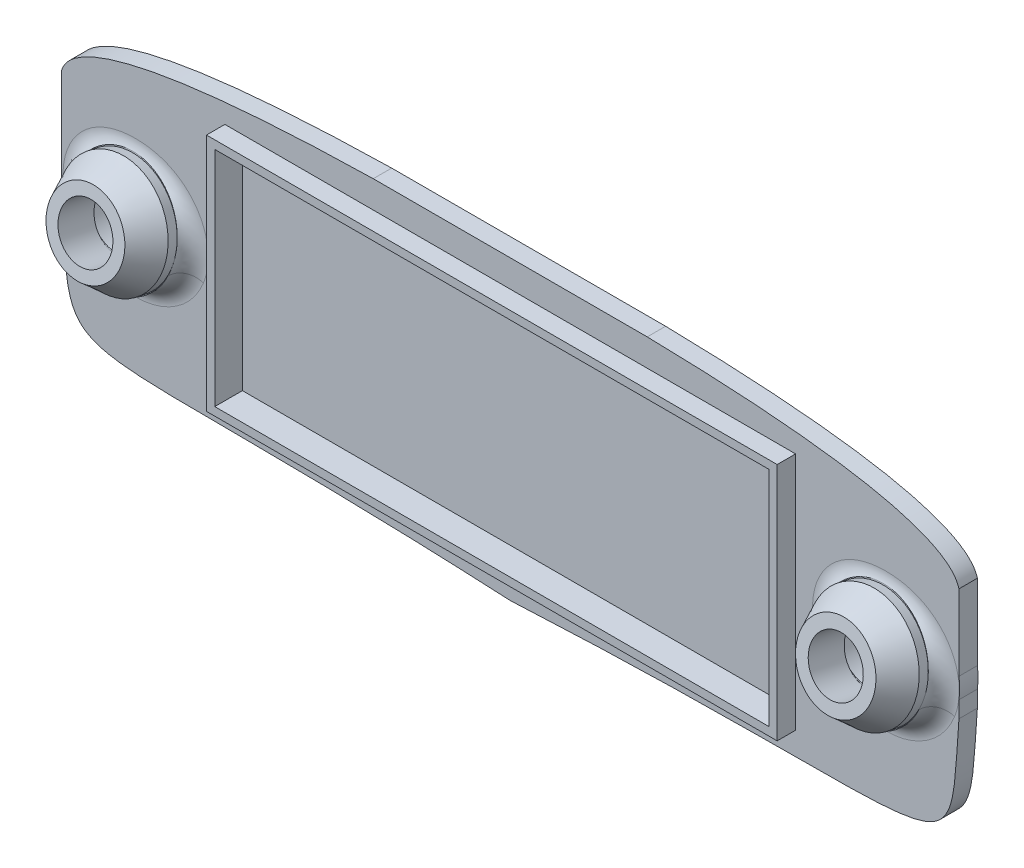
ISO-10303-21;
HEADER;
FILE_DESCRIPTION(('STEP AP214'),'2;1');
FILE_NAME('part.step','',(''),(''),'','','');
FILE_SCHEMA(('AUTOMOTIVE_DESIGN { 1 0 10303 214 1 1 1 1 }'));
ENDSEC;
DATA;
#1=APPLICATION_CONTEXT('core data for automotive mechanical design processes');
#2=APPLICATION_PROTOCOL_DEFINITION('international standard','automotive_design',2000,#1);
#3=PRODUCT_CONTEXT('',#1,'mechanical');
#4=PRODUCT('Part','Part','',(#3));
#5=PRODUCT_RELATED_PRODUCT_CATEGORY('part','',(#4));
#6=PRODUCT_DEFINITION_FORMATION('','',#4);
#7=PRODUCT_DEFINITION_CONTEXT('part definition',#1,'design');
#8=PRODUCT_DEFINITION('design','',#6,#7);
#9=PRODUCT_DEFINITION_SHAPE('','',#8);
#10=(LENGTH_UNIT() NAMED_UNIT(*) SI_UNIT(.MILLI.,.METRE.));
#11=(NAMED_UNIT(*) PLANE_ANGLE_UNIT() SI_UNIT($,.RADIAN.));
#12=(NAMED_UNIT(*) SI_UNIT($,.STERADIAN.) SOLID_ANGLE_UNIT());
#13=UNCERTAINTY_MEASURE_WITH_UNIT(LENGTH_MEASURE(1.E-05),#10,'distance_accuracy_value','');
#14=(GEOMETRIC_REPRESENTATION_CONTEXT(3) GLOBAL_UNCERTAINTY_ASSIGNED_CONTEXT((#13)) GLOBAL_UNIT_ASSIGNED_CONTEXT((#10,
#11,#12)) REPRESENTATION_CONTEXT('',''));
#15=CARTESIAN_POINT('',(0.,0.,0.));
#16=DIRECTION('',(0.,0.,1.));
#17=DIRECTION('',(1.,0.,0.));
#18=AXIS2_PLACEMENT_3D('',#15,#16,#17);
#19=CARTESIAN_POINT('',(0.,0.,4.));
#20=DIRECTION('',(0.,0.,1.));
#21=DIRECTION('',(1.,0.,0.));
#22=AXIS2_PLACEMENT_3D('',#19,#20,#21);
#23=PLANE('',#22);
#24=DIRECTION('',(0.,-1.,0.));
#25=VECTOR('',#24,1.);
#26=CARTESIAN_POINT('',(17.7500000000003,29.2990514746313,4.));
#27=LINE('',#26,#25);
#28=CARTESIAN_POINT('',(17.7500000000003,29.2990514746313,4.));
#29=VERTEX_POINT('',#28);
#30=CARTESIAN_POINT('',(17.7500000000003,3.29905147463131,4.));
#31=VERTEX_POINT('',#30);
#32=EDGE_CURVE('E293',#29,#31,#27,.T.);
#33=ORIENTED_EDGE('',*,*,#32,.T.);
#34=DIRECTION('',(1.,0.,0.));
#35=VECTOR('',#34,1.);
#36=CARTESIAN_POINT('',(17.7500000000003,3.29905147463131,4.));
#37=LINE('',#36,#35);
#38=CARTESIAN_POINT('',(79.7500000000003,3.29905147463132,4.));
#39=VERTEX_POINT('',#38);
#40=EDGE_CURVE('E296',#31,#39,#37,.T.);
#41=ORIENTED_EDGE('',*,*,#40,.T.);
#42=DIRECTION('',(0.,1.,0.));
#43=VECTOR('',#42,1.);
#44=CARTESIAN_POINT('',(79.7500000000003,29.2990514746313,4.));
#45=LINE('',#44,#43);
#46=CARTESIAN_POINT('',(79.7500000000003,29.2990514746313,4.));
#47=VERTEX_POINT('',#46);
#48=EDGE_CURVE('E299',#39,#47,#45,.T.);
#49=ORIENTED_EDGE('',*,*,#48,.T.);
#50=DIRECTION('',(-1.,0.,0.));
#51=VECTOR('',#50,1.);
#52=CARTESIAN_POINT('',(17.7500000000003,29.2990514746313,4.));
#53=LINE('',#52,#51);
#54=EDGE_CURVE('E301',#47,#29,#53,.T.);
#55=ORIENTED_EDGE('',*,*,#54,.T.);
#56=EDGE_LOOP('',(#33,#41,#49,#55));
#57=FACE_BOUND('',#56,.T.);
#58=DIRECTION('',(0.,-1.,0.));
#59=VECTOR('',#58,1.);
#60=CARTESIAN_POINT('',(18.6500000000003,28.3990514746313,4.));
#61=LINE('',#60,#59);
#62=CARTESIAN_POINT('',(18.6500000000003,28.3990514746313,4.));
#63=VERTEX_POINT('',#62);
#64=CARTESIAN_POINT('',(18.6500000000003,4.19905147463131,4.));
#65=VERTEX_POINT('',#64);
#66=EDGE_CURVE('E255',#63,#65,#61,.T.);
#67=ORIENTED_EDGE('',*,*,#66,.F.);
#68=DIRECTION('',(1.,0.,0.));
#69=VECTOR('',#68,1.);
#70=CARTESIAN_POINT('',(18.6500000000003,28.3990514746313,4.));
#71=LINE('',#70,#69);
#72=CARTESIAN_POINT('',(78.8500000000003,28.3990514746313,4.));
#73=VERTEX_POINT('',#72);
#74=EDGE_CURVE('E453',#63,#73,#71,.T.);
#75=ORIENTED_EDGE('',*,*,#74,.T.);
#76=DIRECTION('',(0.,-1.,0.));
#77=VECTOR('',#76,1.);
#78=CARTESIAN_POINT('',(78.8500000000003,28.3990514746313,4.));
#79=LINE('',#78,#77);
#80=CARTESIAN_POINT('',(78.8500000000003,4.19905147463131,4.));
#81=VERTEX_POINT('',#80);
#82=EDGE_CURVE('E259',#73,#81,#79,.T.);
#83=ORIENTED_EDGE('',*,*,#82,.T.);
#84=DIRECTION('',(1.,0.,0.));
#85=VECTOR('',#84,1.);
#86=CARTESIAN_POINT('',(18.6500000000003,4.19905147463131,4.));
#87=LINE('',#86,#85);
#88=EDGE_CURVE('E1185',#65,#81,#87,.T.);
#89=ORIENTED_EDGE('',*,*,#88,.F.);
#90=EDGE_LOOP('',(#67,#75,#83,#89));
#91=FACE_BOUND('',#90,.T.);
#92=ADVANCED_FACE('F38',(#57,#91),#23,.T.);
#93=CARTESIAN_POINT('',(97.5,-1.3781785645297,7.21250529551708));
#94=DIRECTION('',(0.,0.205173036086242,0.978725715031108));
#95=DIRECTION('',(0.,-0.978725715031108,0.205173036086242));
#96=AXIS2_PLACEMENT_3D('',#93,#94,#95);
#97=PLANE('',#96);
#98=CARTESIAN_POINT('',(89.5658152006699,16.1457573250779,3.53891311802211));
#99=DIRECTION('',(0.,0.205173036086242,0.978725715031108));
#100=DIRECTION('',(0.,-0.978725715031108,0.205173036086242));
#101=AXIS2_PLACEMENT_3D('',#98,#99,#100);
#102=CIRCLE('',#101,6.01267156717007);
#103=CARTESIAN_POINT('',(95.57848676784,16.145757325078,3.53891311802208));
#104=VERTEX_POINT('',#103);
#105=CARTESIAN_POINT('',(83.5531436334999,16.145757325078,3.53891311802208));
#106=VERTEX_POINT('',#105);
#107=EDGE_CURVE('E273',#104,#106,#102,.T.);
#108=ORIENTED_EDGE('',*,*,#107,.F.);
#109=CARTESIAN_POINT('',(89.5658152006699,16.1457573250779,3.5389131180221));
#110=DIRECTION('',(0.,0.205173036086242,0.978725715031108));
#111=DIRECTION('',(0.,0.978725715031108,-0.205173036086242));
#112=AXIS2_PLACEMENT_3D('',#109,#110,#111);
#113=ELLIPSE('',#112,6.14336731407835,6.01267156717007);
#114=EDGE_CURVE('E370',#104,#106,#113,.T.);
#115=ORIENTED_EDGE('',*,*,#114,.T.);
#116=EDGE_LOOP('',(#108,#115));
#117=FACE_BOUND('',#116,.T.);
#118=ADVANCED_FACE('F484',(#117),#97,.T.);
#119=CARTESIAN_POINT('',(89.5658152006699,16.1457573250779,3.5389131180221));
#120=DIRECTION('',(0.,0.205173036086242,0.978725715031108));
#121=DIRECTION('',(0.,0.978725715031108,-0.205173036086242));
#122=AXIS2_PLACEMENT_3D('',#119,#120,#121);
#123=ELLIPSE('',#122,2.93198792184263,2.869611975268);
#124=CARTESIAN_POINT('',(89.5658152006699,13.2761453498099,4.14047798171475));
#125=VERTEX_POINT('',#124);
#126=CARTESIAN_POINT('',(91.408878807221,13.9462597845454,4.));
#127=VERTEX_POINT('',#126);
#128=EDGE_CURVE('E365',#125,#127,#123,.T.);
#129=ORIENTED_EDGE('',*,*,#128,.F.);
#130=CARTESIAN_POINT('',(89.5658152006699,16.1457573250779,3.53891311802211));
#131=DIRECTION('',(0.,0.205173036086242,0.978725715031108));
#132=DIRECTION('',(0.,-0.978725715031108,0.205173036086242));
#133=AXIS2_PLACEMENT_3D('',#130,#131,#132);
#134=CIRCLE('',#133,2.93198792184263);
#135=CARTESIAN_POINT('',(91.4489409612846,13.9462597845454,4.));
#136=VERTEX_POINT('',#135);
#137=EDGE_CURVE('E264',#125,#136,#134,.T.);
#138=ORIENTED_EDGE('',*,*,#137,.T.);
#139=DIRECTION('',(-1.,0.,0.));
#140=VECTOR('',#139,1.);
#141=CARTESIAN_POINT('',(97.5,13.9462597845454,4.));
#142=LINE('',#141,#140);
#143=EDGE_CURVE('E641',#136,#127,#142,.T.);
#144=ORIENTED_EDGE('',*,*,#143,.T.);
#145=EDGE_LOOP('',(#129,#138,#144));
#146=FACE_BOUND('',#145,.T.);
#147=ADVANCED_FACE('F491',(#146),#97,.T.);
#148=CARTESIAN_POINT('',(87.7227515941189,13.9462597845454,4.));
#149=VERTEX_POINT('',#148);
#150=CARTESIAN_POINT('',(87.6826894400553,13.9462597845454,4.));
#151=VERTEX_POINT('',#150);
#152=EDGE_CURVE('E643',#149,#151,#142,.T.);
#153=ORIENTED_EDGE('',*,*,#152,.T.);
#154=EDGE_CURVE('E266',#151,#125,#134,.T.);
#155=ORIENTED_EDGE('',*,*,#154,.T.);
#156=EDGE_CURVE('E651',#149,#125,#123,.T.);
#157=ORIENTED_EDGE('',*,*,#156,.F.);
#158=EDGE_LOOP('',(#153,#155,#157));
#159=FACE_BOUND('',#158,.T.);
#160=ADVANCED_FACE('F554',(#159),#97,.T.);
#161=CARTESIAN_POINT('',(97.5,-1.3781785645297,7.21250529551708));
#162=DIRECTION('',(0.,0.205173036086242,0.978725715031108));
#163=DIRECTION('',(0.,-0.978725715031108,0.205173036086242));
#164=AXIS2_PLACEMENT_3D('',#161,#162,#163);
#165=PLANE('',#164);
#166=CARTESIAN_POINT('',(8.05176369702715,16.1457573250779,3.53891311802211));
#167=DIRECTION('',(0.,0.205173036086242,0.978725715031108));
#168=DIRECTION('',(0.,-0.978725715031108,0.205173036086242));
#169=AXIS2_PLACEMENT_3D('',#166,#167,#168);
#170=CIRCLE('',#169,5.92854086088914);
#171=CARTESIAN_POINT('',(13.9803045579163,16.145757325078,3.53891311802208));
#172=VERTEX_POINT('',#171);
#173=CARTESIAN_POINT('',(2.123222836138,16.145757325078,3.53891311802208));
#174=VERTEX_POINT('',#173);
#175=EDGE_CURVE('E283',#172,#174,#170,.T.);
#176=ORIENTED_EDGE('',*,*,#175,.F.);
#177=CARTESIAN_POINT('',(8.05176369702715,16.1457573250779,3.5389131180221));
#178=DIRECTION('',(0.,0.205173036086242,0.978725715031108));
#179=DIRECTION('',(0.,0.978725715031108,-0.205173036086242));
#180=AXIS2_PLACEMENT_3D('',#177,#178,#179);
#181=ELLIPSE('',#180,6.05740788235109,5.92854086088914);
#182=EDGE_CURVE('E344',#172,#174,#181,.T.);
#183=ORIENTED_EDGE('',*,*,#182,.T.);
#184=EDGE_LOOP('',(#176,#183));
#185=FACE_BOUND('',#184,.T.);
#186=ADVANCED_FACE('F531',(#185),#165,.T.);
#187=CARTESIAN_POINT('',(8.05176369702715,16.1457573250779,3.5389131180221));
#188=DIRECTION('',(0.,0.205173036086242,0.978725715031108));
#189=DIRECTION('',(0.,0.978725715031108,-0.205173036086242));
#190=AXIS2_PLACEMENT_3D('',#187,#188,#189);
#191=ELLIPSE('',#190,2.93198792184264,2.86961197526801);
#192=CARTESIAN_POINT('',(9.03652709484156,13.4504068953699,4.1039470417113));
#193=VERTEX_POINT('',#192);
#194=CARTESIAN_POINT('',(9.89482730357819,13.9462597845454,4.));
#195=VERTEX_POINT('',#194);
#196=EDGE_CURVE('E337',#193,#195,#191,.T.);
#197=ORIENTED_EDGE('',*,*,#196,.F.);
#198=CARTESIAN_POINT('',(8.05176369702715,16.1457573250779,3.53891311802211));
#199=DIRECTION('',(0.,0.205173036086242,0.978725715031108));
#200=DIRECTION('',(0.,-0.978725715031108,0.205173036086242));
#201=AXIS2_PLACEMENT_3D('',#198,#199,#200);
#202=CIRCLE('',#201,2.92471130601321);
#203=CARTESIAN_POINT('',(9.92353977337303,13.9462597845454,4.));
#204=VERTEX_POINT('',#203);
#205=EDGE_CURVE('E284',#193,#204,#202,.T.);
#206=ORIENTED_EDGE('',*,*,#205,.T.);
#207=DIRECTION('',(-1.,0.,0.));
#208=VECTOR('',#207,1.);
#209=CARTESIAN_POINT('',(97.5,13.9462597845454,4.));
#210=LINE('',#209,#208);
#211=EDGE_CURVE('E622',#204,#195,#210,.T.);
#212=ORIENTED_EDGE('',*,*,#211,.T.);
#213=EDGE_LOOP('',(#197,#206,#212));
#214=FACE_BOUND('',#213,.T.);
#215=ADVANCED_FACE('F621',(#214),#165,.T.);
#216=CARTESIAN_POINT('',(6.2087000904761,13.9462597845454,4.));
#217=VERTEX_POINT('',#216);
#218=CARTESIAN_POINT('',(6.17998762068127,13.9462597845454,4.));
#219=VERTEX_POINT('',#218);
#220=EDGE_CURVE('E629',#217,#219,#210,.T.);
#221=ORIENTED_EDGE('',*,*,#220,.T.);
#222=CARTESIAN_POINT('',(7.06700029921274,13.4504068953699,4.1039470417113));
#223=VERTEX_POINT('',#222);
#224=EDGE_CURVE('E288',#219,#223,#202,.T.);
#225=ORIENTED_EDGE('',*,*,#224,.T.);
#226=EDGE_CURVE('E345',#217,#223,#191,.T.);
#227=ORIENTED_EDGE('',*,*,#226,.F.);
#228=EDGE_LOOP('',(#221,#225,#227));
#229=FACE_BOUND('',#228,.T.);
#230=ADVANCED_FACE('F400',(#229),#165,.T.);
#231=CARTESIAN_POINT('',(0.,0.,2.));
#232=DIRECTION('',(0.,0.,-1.));
#233=DIRECTION('',(-1.,0.,0.));
#234=AXIS2_PLACEMENT_3D('',#231,#232,#233);
#235=PLANE('',#234);
#236=CARTESIAN_POINT('',(2.83623201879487,18.9645914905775,2.94799295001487));
#237=CARTESIAN_POINT('',(2.35559752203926,19.3003766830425,2.));
#238=CARTESIAN_POINT('',(1.44184984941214,19.9387472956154,2.));
#239=CARTESIAN_POINT('',(2.69084744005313,18.6955774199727,3.0043871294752));
#240=CARTESIAN_POINT('',(2.19669352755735,18.9963058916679,2.));
#241=CARTESIAN_POINT('',(1.21246727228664,19.6103689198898,2.));
#242=CARTESIAN_POINT('',(2.56779595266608,18.4180981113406,3.06255590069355));
#243=CARTESIAN_POINT('',(2.06851391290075,18.6832878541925,2.));
#244=CARTESIAN_POINT('',(1.01095803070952,19.2620402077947,2.));
#245=CARTESIAN_POINT('',(2.36647204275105,17.8531189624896,3.18099407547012));
#246=CARTESIAN_POINT('',(1.87113295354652,18.0474069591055,2.));
#247=CARTESIAN_POINT('',(0.670272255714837,18.5364715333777,2.));
#248=CARTESIAN_POINT('',(2.28818679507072,17.5656220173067,3.24126287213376));
#249=CARTESIAN_POINT('',(1.80301382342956,17.7238905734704,2.));
#250=CARTESIAN_POINT('',(0.531077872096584,18.1592398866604,2.));
#251=CARTESIAN_POINT('',(2.17629405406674,16.9892961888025,3.36207968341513));
#252=CARTESIAN_POINT('',(1.72538956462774,17.0814753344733,2.));
#253=CARTESIAN_POINT('',(0.319775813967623,17.3911927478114,2.));
#254=CARTESIAN_POINT('',(2.14217225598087,16.7005226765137,3.42261609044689));
#255=CARTESIAN_POINT('',(1.71645146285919,16.7621360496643,2.));
#256=CARTESIAN_POINT('',(0.246898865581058,17.000589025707,2.));
#257=CARTESIAN_POINT('',(2.11622843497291,16.123307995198,3.54361923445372));
#258=CARTESIAN_POINT('',(1.75287145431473,16.1341322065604,2.));
#259=CARTESIAN_POINT('',(0.167072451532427,16.2127200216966,2.));
#260=CARTESIAN_POINT('',(2.12440877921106,15.8348668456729,3.60408596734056));
#261=CARTESIAN_POINT('',(1.79958601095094,15.8254613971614,2.));
#262=CARTESIAN_POINT('',(0.160126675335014,15.8154543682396,2.));
#263=CARTESIAN_POINT('',(2.18255593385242,15.2601930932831,3.72455644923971));
#264=CARTESIAN_POINT('',(1.94373825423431,15.2247239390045,2.));
#265=CARTESIAN_POINT('',(0.212052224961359,15.0212624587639,2.));
#266=CARTESIAN_POINT('',(2.23294095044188,14.9740116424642,3.78454947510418));
#267=CARTESIAN_POINT('',(2.04305180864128,14.9332956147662,2.));
#268=CARTESIAN_POINT('',(0.271584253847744,14.6243795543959,2.));
#269=CARTESIAN_POINT('',(2.37507800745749,14.4117031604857,3.90242779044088));
#270=CARTESIAN_POINT('',(2.28661068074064,14.3783952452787,2.));
#271=CARTESIAN_POINT('',(0.455205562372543,13.8458697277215,2.));
#272=CARTESIAN_POINT('',(2.46683260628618,14.1355767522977,3.96031294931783));
#273=CARTESIAN_POINT('',(2.43213956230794,14.1156694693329,2.));
#274=CARTESIAN_POINT('',(0.579298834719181,13.4642437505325,2.));
#275=CARTESIAN_POINT('',(2.69259761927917,13.5933561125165,4.0739801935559));
#276=CARTESIAN_POINT('',(2.76394851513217,13.6195150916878,2.));
#277=CARTESIAN_POINT('',(0.890821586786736,12.7194310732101,2.));
#278=CARTESIAN_POINT('',(2.82736269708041,13.3275442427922,4.12970308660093));
#279=CARTESIAN_POINT('',(2.95193271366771,13.3879955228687,2.));
#280=CARTESIAN_POINT('',(1.07938686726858,12.3567197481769,2.));
#281=CARTESIAN_POINT('',(3.13685737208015,12.8170334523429,4.23672290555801));
#282=CARTESIAN_POINT('',(3.35827962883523,12.9642170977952,2.));
#283=CARTESIAN_POINT('',(1.51322491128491,11.6670115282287,2.));
#284=CARTESIAN_POINT('',(3.31159090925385,12.5723366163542,4.2880193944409));
#285=CARTESIAN_POINT('',(3.57733009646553,12.7734006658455,2.));
#286=CARTESIAN_POINT('',(1.75850326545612,11.3400181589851,2.));
#287=CARTESIAN_POINT('',(3.70380677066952,12.1036447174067,4.38627260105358));
#288=CARTESIAN_POINT('',(4.04332890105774,12.427549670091,2.));
#289=CARTESIAN_POINT('',(2.30560667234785,10.7215337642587,2.));
#290=CARTESIAN_POINT('',(3.92230743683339,11.8803783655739,4.43307655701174));
#291=CARTESIAN_POINT('',(4.29084022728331,12.2754391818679,2.));
#292=CARTESIAN_POINT('',(2.60876863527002,10.4312261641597,2.));
#293=CARTESIAN_POINT('',(4.39516867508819,11.4686650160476,4.51938518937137));
#294=CARTESIAN_POINT('',(4.79978601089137,12.0119812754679,2.));
#295=CARTESIAN_POINT('',(3.25796168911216,9.90340819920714,2.));
#296=CARTESIAN_POINT('',(4.64953483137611,11.2802234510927,4.55888872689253));
#297=CARTESIAN_POINT('',(5.06068960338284,11.9023134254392,2.));
#298=CARTESIAN_POINT('',(3.60399945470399,9.66590607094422,2.));
#299=CARTESIAN_POINT('',(5.19919096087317,10.9381594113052,4.63059657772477));
#300=CARTESIAN_POINT('',(5.59975081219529,11.7153749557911,2.));
#301=CARTESIAN_POINT('',(4.34306103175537,9.24055706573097,2.));
#302=CARTESIAN_POINT('',(5.49567274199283,10.7861413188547,4.66246455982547));
#303=CARTESIAN_POINT('',(5.87656550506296,11.641143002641,2.));
#304=CARTESIAN_POINT('',(4.73737447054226,9.05495264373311,2.));
#305=CARTESIAN_POINT('',(6.11369103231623,10.5330043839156,4.71553037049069));
#306=CARTESIAN_POINT('',(6.43287810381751,11.5241167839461,2.));
#307=CARTESIAN_POINT('',(5.55061054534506,8.74921252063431,2.));
#308=CARTESIAN_POINT('',(6.43523436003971,10.4318994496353,4.73672528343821));
#309=CARTESIAN_POINT('',(6.71029287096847,11.4824295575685,2.));
#310=CARTESIAN_POINT('',(5.96953987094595,8.62909470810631,2.));
#311=CARTESIAN_POINT('',(7.1087148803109,10.2820859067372,4.76813111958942));
#312=CARTESIAN_POINT('',(7.27957242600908,11.4221928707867,2.));
#313=CARTESIAN_POINT('',(6.84100006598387,8.45204850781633,2.));
#314=CARTESIAN_POINT('',(7.46137024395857,10.2360499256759,4.7777817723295));
#315=CARTESIAN_POINT('',(7.56846067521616,11.4054799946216,2.));
#316=CARTESIAN_POINT('',(7.29418601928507,8.39833931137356,2.));
#317=CARTESIAN_POINT('',(8.16980610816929,10.2077952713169,4.78370487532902));
#318=CARTESIAN_POINT('',(8.14901816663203,11.3949468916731,2.));
#319=CARTESIAN_POINT('',(8.20331605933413,8.36530335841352,2.));
#320=CARTESIAN_POINT('',(8.52558730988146,10.2255913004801,4.77997424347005));
#321=CARTESIAN_POINT('',(8.43749833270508,11.401245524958,2.));
#322=CARTESIAN_POINT('',(8.65926075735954,8.38599373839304,2.));
#323=CARTESIAN_POINT('',(9.23696758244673,10.3254751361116,4.7590353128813));
#324=CARTESIAN_POINT('',(9.02746702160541,11.4396105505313,2.));
#325=CARTESIAN_POINT('',(9.5751491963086,8.50326841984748,2.));
#326=CARTESIAN_POINT('',(9.59224783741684,10.4094554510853,4.7414302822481));
#327=CARTESIAN_POINT('',(9.32583288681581,11.4720001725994,2.));
#328=CARTESIAN_POINT('',(10.0348099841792,8.60208703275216,2.));
#329=CARTESIAN_POINT('',(10.2779075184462,10.6391547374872,4.69327777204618));
#330=CARTESIAN_POINT('',(9.92619913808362,11.5720826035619,2.));
#331=CARTESIAN_POINT('',(10.9304908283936,8.87689162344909,2.));
#332=CARTESIAN_POINT('',(10.6082904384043,10.7848650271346,4.66273211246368));
#333=CARTESIAN_POINT('',(10.2253148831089,11.6386521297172,2.));
#334=CARTESIAN_POINT('',(11.3665141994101,9.05286674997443,2.));
#335=CARTESIAN_POINT('',(11.2275346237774,11.1272859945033,4.59094943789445));
#336=CARTESIAN_POINT('',(10.8157449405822,11.8162451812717,2.));
#337=CARTESIAN_POINT('',(12.1934230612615,9.47465345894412,2.));
#338=CARTESIAN_POINT('',(11.5170446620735,11.3230153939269,4.54991813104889));
#339=CARTESIAN_POINT('',(11.1050260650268,11.9246637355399,2.));
#340=CARTESIAN_POINT('',(12.584988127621,9.71912921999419,2.));
#341=CARTESIAN_POINT('',(12.0539655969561,11.7583371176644,4.4586604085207));
#342=CARTESIAN_POINT('',(11.6708031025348,12.1939745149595,2.));
#343=CARTESIAN_POINT('',(13.3189158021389,10.2734733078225,2.));
#344=CARTESIAN_POINT('',(12.301376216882,11.9979297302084,4.40843393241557));
#345=CARTESIAN_POINT('',(11.9463798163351,12.3526980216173,2.));
#346=CARTESIAN_POINT('',(13.6612780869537,10.5833420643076,2.));
#347=CARTESIAN_POINT('',(12.7452545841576,12.5082580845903,4.30145235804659));
#348=CARTESIAN_POINT('',(12.4673261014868,12.7231886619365,2.));
#349=CARTESIAN_POINT('',(14.2795219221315,11.2545409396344,2.));
#350=CARTESIAN_POINT('',(12.942461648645,12.7784453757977,4.24481223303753));
#351=CARTESIAN_POINT('',(12.7130729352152,12.9317908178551,2.));
#352=CARTESIAN_POINT('',(14.5563634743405,11.6149860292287,2.));
#353=CARTESIAN_POINT('',(13.287422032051,13.3448202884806,4.12608146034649));
#354=CARTESIAN_POINT('',(13.165366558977,13.4013085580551,2.));
#355=CARTESIAN_POINT('',(15.0399245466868,12.3799563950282,2.));
#356=CARTESIAN_POINT('',(13.4352242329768,13.640981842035,4.06399627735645));
#357=CARTESIAN_POINT('',(13.3728685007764,13.6601838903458,2.));
#358=CARTESIAN_POINT('',(15.2467133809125,12.7844375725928,2.));
#359=CARTESIAN_POINT('',(13.6483333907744,14.1743547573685,3.95218380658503));
#360=CARTESIAN_POINT('',(13.6911193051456,14.1541030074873,2.));
#361=CARTESIAN_POINT('',(15.5397999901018,13.5179337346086,2.));
#362=CARTESIAN_POINT('',(13.7250496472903,14.4075390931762,3.90330071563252));
#363=CARTESIAN_POINT('',(13.8128673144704,14.3763917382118,2.));
#364=CARTESIAN_POINT('',(15.643342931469,13.8401733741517,2.));
#365=CARTESIAN_POINT('',(13.8490552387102,14.8812702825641,3.80399110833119));
#366=CARTESIAN_POINT('',(14.0229543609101,14.8420681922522,2.));
#367=CARTESIAN_POINT('',(15.8046051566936,14.495923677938,2.));
#368=CARTESIAN_POINT('',(13.8963484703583,15.1218161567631,3.75356479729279));
#369=CARTESIAN_POINT('',(14.1120609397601,15.0849936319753,2.));
#370=CARTESIAN_POINT('',(15.8623305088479,14.82943284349,2.));
#371=CARTESIAN_POINT('',(13.967624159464,15.6581052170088,3.64114100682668));
#372=CARTESIAN_POINT('',(14.267312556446,15.6382570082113,2.));
#373=CARTESIAN_POINT('',(15.9374360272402,15.5715105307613,2.));
#374=CARTESIAN_POINT('',(13.984691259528,15.9549008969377,3.57892289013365));
#375=CARTESIAN_POINT('',(14.3265637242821,15.9531937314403,2.));
#376=CARTESIAN_POINT('',(15.9438960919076,15.9812318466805,2.));
#377=CARTESIAN_POINT('',(13.9739993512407,16.5499025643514,3.45419100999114));
#378=CARTESIAN_POINT('',(14.3851044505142,16.5965488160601,2.));
#379=CARTESIAN_POINT('',(15.8866102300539,16.7959213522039,2.));
#380=CARTESIAN_POINT('',(13.9462174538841,16.8481091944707,3.39167711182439));
#381=CARTESIAN_POINT('',(14.3858589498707,16.92491643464,2.));
#382=CARTESIAN_POINT('',(15.8228284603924,17.2008870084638,2.));
#383=CARTESIAN_POINT('',(13.8459203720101,17.4350889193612,3.26862689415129));
#384=CARTESIAN_POINT('',(14.3249725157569,17.5776443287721,2.));
#385=CARTESIAN_POINT('',(15.6281969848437,17.9866127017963,2.));
#386=CARTESIAN_POINT('',(13.7742224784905,17.7239351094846,3.20807525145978));
#387=CARTESIAN_POINT('',(14.2658062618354,17.9021450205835,2.));
#388=CARTESIAN_POINT('',(15.4985798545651,18.3676778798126,2.));
#389=CARTESIAN_POINT('',(13.5862017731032,18.2921815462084,3.08895214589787));
#390=CARTESIAN_POINT('',(14.0862718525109,18.5413903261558,2.));
#391=CARTESIAN_POINT('',(15.1764493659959,19.1021506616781,2.));
#392=CARTESIAN_POINT('',(13.4698883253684,18.5715837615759,3.03038027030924));
#393=CARTESIAN_POINT('',(13.9670509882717,18.8567555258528,2.));
#394=CARTESIAN_POINT('',(14.9839492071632,19.455564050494,2.));
#395=CARTESIAN_POINT('',(13.1938980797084,19.1117144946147,2.91715113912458));
#396=CARTESIAN_POINT('',(13.6708639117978,19.4627320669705,2.));
#397=CARTESIAN_POINT('',(14.5442480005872,20.1204902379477,2.));
#398=CARTESIAN_POINT('',(13.0347525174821,19.372625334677,2.86245566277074));
#399=CARTESIAN_POINT('',(13.495472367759,19.7543721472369,2.));
#400=CARTESIAN_POINT('',(14.2977235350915,20.4324506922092,2.));
#401=CARTESIAN_POINT('',(12.6726710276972,19.8727059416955,2.75762235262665));
#402=CARTESIAN_POINT('',(13.0905551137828,20.3062894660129,2.));
#403=CARTESIAN_POINT('',(13.7560794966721,21.0107146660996,2.));
#404=CARTESIAN_POINT('',(12.4697374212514,20.111876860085,2.70748427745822));
#405=CARTESIAN_POINT('',(12.8615425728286,20.5675732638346,2.));
#406=CARTESIAN_POINT('',(13.4609624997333,21.2770206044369,2.));
#407=CARTESIAN_POINT('',(12.0196084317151,20.5622648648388,2.61306816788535));
#408=CARTESIAN_POINT('',(12.3537561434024,21.0505685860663,2.));
#409=CARTESIAN_POINT('',(12.8291246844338,21.7588771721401,2.));
#410=CARTESIAN_POINT('',(11.772171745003,20.7733180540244,2.56882449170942));
#411=CARTESIAN_POINT('',(12.0748325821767,21.2731601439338,2.));
#412=CARTESIAN_POINT('',(12.4921803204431,21.9741354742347,2.));
#413=CARTESIAN_POINT('',(11.3708438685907,21.0608847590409,2.50854107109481));
#414=CARTESIAN_POINT('',(11.6251551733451,21.5705606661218,2.));
#415=CARTESIAN_POINT('',(11.9647923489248,22.2546106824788,2.));
#416=CARTESIAN_POINT('',(11.2319912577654,21.1519285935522,2.48945529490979));
#417=CARTESIAN_POINT('',(11.4705913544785,21.6634107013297,2.));
#418=CARTESIAN_POINT('',(11.7852752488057,22.3410539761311,2.));
#419=CARTESIAN_POINT('',(10.9447388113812,21.3232296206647,2.45354497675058));
#420=CARTESIAN_POINT('',(11.1525488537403,21.8361056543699,2.));
#421=CARTESIAN_POINT('',(11.4201123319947,22.4998211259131,2.));
#422=CARTESIAN_POINT('',(10.7963412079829,21.4034893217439,2.43671990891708));
#423=CARTESIAN_POINT('',(10.9890104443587,21.9160774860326,2.));
#424=CARTESIAN_POINT('',(11.2344679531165,22.5721482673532,2.));
#425=CARTESIAN_POINT('',(10.4820806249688,21.5562467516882,2.40469693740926));
#426=CARTESIAN_POINT('',(10.6447854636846,22.0665073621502,2.));
#427=CARTESIAN_POINT('',(10.8476235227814,22.7065257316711,2.));
#428=CARTESIAN_POINT('',(10.3157042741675,21.6280416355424,2.38964637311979));
#429=CARTESIAN_POINT('',(10.463505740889,22.1363123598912,2.));
#430=CARTESIAN_POINT('',(10.6461398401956,22.7677556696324,2.));
#431=CARTESIAN_POINT('',(9.97443224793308,21.7568354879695,2.36264695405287));
#432=CARTESIAN_POINT('',(10.0940232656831,22.2601061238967,2.));
#433=CARTESIAN_POINT('',(10.239184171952,22.8750304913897,2.));
#434=CARTESIAN_POINT('',(9.79953625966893,21.8138339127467,2.35069821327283));
#435=CARTESIAN_POINT('',(9.90568450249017,22.314207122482,2.));
#436=CARTESIAN_POINT('',(10.03371204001,22.9210748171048,2.));
#437=CARTESIAN_POINT('',(9.44259761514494,21.9118198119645,2.33015715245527));
#438=CARTESIAN_POINT('',(9.52349526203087,22.4063211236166,2.));
#439=CARTESIAN_POINT('',(9.61969966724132,22.9986913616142,2.));
#440=CARTESIAN_POINT('',(9.26054298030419,21.9527790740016,2.3215707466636));
#441=CARTESIAN_POINT('',(9.32947073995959,22.4443944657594,2.));
#442=CARTESIAN_POINT('',(9.41115468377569,23.0302380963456,2.));
#443=CARTESIAN_POINT('',(8.89168999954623,22.0174851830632,2.30800622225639));
#444=CARTESIAN_POINT('',(8.93806426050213,22.5041456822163,2.));
#445=CARTESIAN_POINT('',(8.99243251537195,23.0794348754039,2.));
#446=CARTESIAN_POINT('',(8.7048911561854,22.0412302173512,2.30302848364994));
#447=CARTESIAN_POINT('',(8.74049572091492,22.5258813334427,2.));
#448=CARTESIAN_POINT('',(8.78225516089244,23.0970834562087,2.));
#449=CARTESIAN_POINT('',(8.29334796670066,22.0736148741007,2.29623959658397));
#450=CARTESIAN_POINT('',(8.30629143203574,22.5554550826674,2.));
#451=CARTESIAN_POINT('',(8.3211978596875,23.121086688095,2.));
#452=CARTESIAN_POINT('',(8.06813602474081,22.078528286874,2.29520958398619));
#453=CARTESIAN_POINT('',(8.06901225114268,22.5599131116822,2.));
#454=CARTESIAN_POINT('',(8.07017017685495,23.1246591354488,2.));
#455=CARTESIAN_POINT('',(7.61910922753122,22.0627583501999,2.29851548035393));
#456=CARTESIAN_POINT('',(7.59579303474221,22.5455455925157,2.));
#457=CARTESIAN_POINT('',(7.56851342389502,23.1130370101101,2.));
#458=CARTESIAN_POINT('',(7.39529458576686,22.0420711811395,2.30285219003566));
#459=CARTESIAN_POINT('',(7.35951073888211,22.5266957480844,2.));
#460=CARTESIAN_POINT('',(7.31788441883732,23.0978396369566,2.));
#461=CARTESIAN_POINT('',(6.95373537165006,21.9759998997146,2.31670289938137));
#462=CARTESIAN_POINT('',(6.89182816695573,22.4659061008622,2.));
#463=CARTESIAN_POINT('',(6.8188171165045,23.0480258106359,2.));
#464=CARTESIAN_POINT('',(6.73598430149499,21.9306433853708,2.32621111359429));
#465=CARTESIAN_POINT('',(6.66010127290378,22.4239058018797,2.));
#466=CARTESIAN_POINT('',(6.57037668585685,23.0134310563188,2.));
#467=CARTESIAN_POINT('',(6.31003757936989,21.8169633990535,2.35004217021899));
#468=CARTESIAN_POINT('',(6.20437320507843,22.3171992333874,2.));
#469=CARTESIAN_POINT('',(6.07724632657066,22.9236930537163,2.));
#470=CARTESIAN_POINT('',(6.10183944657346,21.7486459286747,2.36436375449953));
#471=CARTESIAN_POINT('',(5.98009063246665,22.2523534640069,2.));
#472=CARTESIAN_POINT('',(5.83255543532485,22.8685551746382,2.));
#473=CARTESIAN_POINT('',(5.72726656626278,21.6027375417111,2.39495094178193));
#474=CARTESIAN_POINT('',(5.57414704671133,22.1117746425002,2.));
#475=CARTESIAN_POINT('',(5.38434061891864,22.7462773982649,2.));
#476=CARTESIAN_POINT('',(5.55922129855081,21.5279533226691,2.4106281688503));
#477=CARTESIAN_POINT('',(5.39077503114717,22.0388389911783,2.));
#478=CARTESIAN_POINT('',(5.18001854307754,22.6820617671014,2.));
#479=CARTESIAN_POINT('',(5.23336084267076,21.3647050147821,2.44485037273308));
#480=CARTESIAN_POINT('',(5.0332493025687,21.8775314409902,2.));
#481=CARTESIAN_POINT('',(4.77712598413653,22.5374031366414,2.));
#482=CARTESIAN_POINT('',(5.07554767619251,21.276238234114,2.46339591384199));
#483=CARTESIAN_POINT('',(4.85899186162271,21.7890145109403,2.));
#484=CARTESIAN_POINT('',(4.5785566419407,22.4569569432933,2.));
#485=CARTESIAN_POINT('',(4.77125377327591,21.0872060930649,2.50302325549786));
#486=CARTESIAN_POINT('',(4.52137377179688,21.5974965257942,2.));
#487=CARTESIAN_POINT('',(4.18898411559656,22.2797938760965,2.));
#488=CARTESIAN_POINT('',(4.62476425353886,20.9866502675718,2.52410305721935));
#489=CARTESIAN_POINT('',(4.35793376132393,21.4943497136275,2.));
#490=CARTESIAN_POINT('',(3.99797512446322,22.1830898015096,2.));
#491=CARTESIAN_POINT('',(4.34358608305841,20.7747976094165,2.56851432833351));
#492=CARTESIAN_POINT('',(4.04309341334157,21.2745466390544,2.));
#493=CARTESIAN_POINT('',(3.62492900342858,21.9735409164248,2.));
#494=CARTESIAN_POINT('',(4.20890124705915,20.6634973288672,2.59184652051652));
#495=CARTESIAN_POINT('',(3.89166271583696,21.1577201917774,2.));
#496=CARTESIAN_POINT('',(3.44289478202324,21.8606909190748,2.));
#497=CARTESIAN_POINT('',(3.95136221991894,20.4311386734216,2.64055652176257));
#498=CARTESIAN_POINT('',(3.60156821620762,20.911374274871,2.));
#499=CARTESIAN_POINT('',(3.08882876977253,21.6189534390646,2.));
#500=CARTESIAN_POINT('',(3.82855237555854,20.3100466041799,2.66594139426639));
#501=CARTESIAN_POINT('',(3.46295662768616,20.7816423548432,2.));
#502=CARTESIAN_POINT('',(2.91683535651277,21.4900096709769,2.));
#503=CARTESIAN_POINT('',(3.59555212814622,20.0597107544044,2.718420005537));
#504=CARTESIAN_POINT('',(3.20011036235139,20.5111881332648,2.));
#505=CARTESIAN_POINT('',(2.58504172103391,21.2171557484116,2.));
#506=CARTESIAN_POINT('',(3.48536677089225,19.9304637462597,2.74551442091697));
#507=CARTESIAN_POINT('',(3.07591673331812,20.3702914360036,2.));
#508=CARTESIAN_POINT('',(2.42524638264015,21.0732396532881,2.));
#509=CARTESIAN_POINT('',(3.27783933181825,19.6650761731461,2.80114836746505));
#510=CARTESIAN_POINT('',(2.84285112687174,20.0790678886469,2.));
#511=CARTESIAN_POINT('',(2.11936477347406,20.7715163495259,2.));
#512=CARTESIAN_POINT('',(3.1804957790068,19.5289364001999,2.82968773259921));
#513=CARTESIAN_POINT('',(2.73404450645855,19.9285775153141,2.));
#514=CARTESIAN_POINT('',(1.97327693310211,20.6137107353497,2.));
#515=CARTESIAN_POINT('',(2.99869862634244,19.250875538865,2.88797841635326));
#516=CARTESIAN_POINT('',(2.53239967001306,19.6197436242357,2.));
#517=CARTESIAN_POINT('',(1.69606350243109,20.2854372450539,2.));
#518=CARTESIAN_POINT('',(2.91424967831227,19.1089523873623,2.91773016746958));
#519=CARTESIAN_POINT('',(2.4396654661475,19.4612449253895,2.));
#520=CARTESIAN_POINT('',(1.56494331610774,20.1149648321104,2.));
#521=CARTESIAN_POINT('',(2.83623201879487,18.9645914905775,2.94799295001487));
#522=CARTESIAN_POINT('',(2.35559752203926,19.3003766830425,2.));
#523=CARTESIAN_POINT('',(1.44184984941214,19.9387472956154,2.));
#524=(BOUNDED_SURFACE() B_SPLINE_SURFACE(3,2,((#236,#237,#238),(#239,#240,#241),(#242,#243,
#244),(#245,#246,#247),(#248,#249,#250),(#251,#252,#253),(#254,#255,#256),(#257,#258,#259),
(#260,#261,#262),(#263,#264,#265),(#266,#267,#268),(#269,#270,#271),(#272,#273,#274),(#275,#276,
#277),(#278,#279,#280),(#281,#282,#283),(#284,#285,#286),(#287,#288,#289),(#290,#291,#292),
(#293,#294,#295),(#296,#297,#298),(#299,#300,#301),(#302,#303,#304),(#305,#306,#307),(#308,#309,
#310),(#311,#312,#313),(#314,#315,#316),(#317,#318,#319),(#320,#321,#322),(#323,#324,#325),
(#326,#327,#328),(#329,#330,#331),(#332,#333,#334),(#335,#336,#337),(#338,#339,#340),(#341,#342,
#343),(#344,#345,#346),(#347,#348,#349),(#350,#351,#352),(#353,#354,#355),(#356,#357,#358),
(#359,#360,#361),(#362,#363,#364),(#365,#366,#367),(#368,#369,#370),(#371,#372,#373),(#374,#375,
#376),(#377,#378,#379),(#380,#381,#382),(#383,#384,#385),(#386,#387,#388),(#389,#390,#391),
(#392,#393,#394),(#395,#396,#397),(#398,#399,#400),(#401,#402,#403),(#404,#405,#406),(#407,#408,
#409),(#410,#411,#412),(#413,#414,#415),(#416,#417,#418),(#419,#420,#421),(#422,#423,#424),
(#425,#426,#427),(#428,#429,#430),(#431,#432,#433),(#434,#435,#436),(#437,#438,#439),(#440,#441,
#442),(#443,#444,#445),(#446,#447,#448),(#449,#450,#451),(#452,#453,#454),(#455,#456,#457),
(#458,#459,#460),(#461,#462,#463),(#464,#465,#466),(#467,#468,#469),(#470,#471,#472),(#473,#474,
#475),(#476,#477,#478),(#479,#480,#481),(#482,#483,#484),(#485,#486,#487),(#488,#489,#490),
(#491,#492,#493),(#494,#495,#496),(#497,#498,#499),(#500,#501,#502),(#503,#504,#505),(#506,#507,
#508),(#509,#510,#511),(#512,#513,#514),(#515,#516,#517),(#518,#519,#520),(#521,#522,#523)),
.UNSPECIFIED.,.T.,.F.,.F.) B_SPLINE_SURFACE_WITH_KNOTS((4,2,2,2,2,2,2,2,2,2,2,2,2,2,2,2,2,2,2,2,
2,2,2,2,2,2,2,2,2,2,2,2,2,2,2,2,2,2,2,2,2,2,2,2,2,2,2,4),(3,3),(0.,1.20090093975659,
2.40145765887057,3.58790364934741,4.77441603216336,5.97282659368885,7.17131127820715,
8.3921016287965,9.61301237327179,10.8665768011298,12.1203366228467,13.4219725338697,
14.7239638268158,16.0868680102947,17.4500861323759,18.8537646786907,20.2572458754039,
21.6350639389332,23.0128910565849,24.3690703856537,25.72390388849,26.7361968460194,
27.7483557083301,28.9715289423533,30.1953266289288,31.3970132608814,32.5984478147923,
33.7856180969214,34.9727254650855,36.1664750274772,36.763721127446,37.3608280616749,
37.9919576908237,38.6231105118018,39.2553685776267,39.887693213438,40.6401329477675,
41.3926849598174,42.1443968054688,42.8959123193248,43.5377961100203,44.1798063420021,
44.8213134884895,45.4630271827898,46.1070515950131,46.751332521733,47.3955395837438,
48.039978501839),(0.,1.),
.UNSPECIFIED.) GEOMETRIC_REPRESENTATION_ITEM() RATIONAL_B_SPLINE_SURFACE(((1.,0.873499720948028,
1.),(1.,0.865429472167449,1.),(1.,0.85699306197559,1.),(1.,0.839540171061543,1.),(1.,
0.830523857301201,1.),(1.,0.812135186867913,1.),(1.,0.802768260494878,1.),(1.,0.783700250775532,
1.),(1.,0.77399914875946,1.),(1.,0.754293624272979,1.),(1.,0.744287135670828,1.),(1.,
0.724219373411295,1.),(1.,0.714158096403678,1.),(1.,0.693980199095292,1.),(1.,0.683866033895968,
1.),(1.,0.664016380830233,1.),(1.,0.654280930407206,1.),(1.,0.635236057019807,1.),(1.,
0.625944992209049,1.),(1.,0.608465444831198,1.),(1.,0.600277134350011,1.),(1.,0.585158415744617,
1.),(1.,0.578287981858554,1.),(1.,0.566702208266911,1.),(1.,0.561987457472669,1.),(1.,
0.554960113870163,1.),(1.,0.552770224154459,1.),(1.,0.551429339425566,1.),(1.,0.552279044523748,
1.),(1.,0.556997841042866,1.),(1.,0.560955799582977,1.),(1.,0.571583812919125,1.),(1.,
0.578253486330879,1.),(1.,0.59356529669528,1.),(1.,0.602169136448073,1.),(1.,0.620823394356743,
1.),(1.,0.630873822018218,1.),(1.,0.651723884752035,1.),(1.,0.66250926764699,1.),(1.,
0.684544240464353,1.),(1.,0.695793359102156,1.),(1.,0.715559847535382,1.),(1.,0.724048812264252,
1.),(1.,0.740995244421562,1.),(1.,0.749452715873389,1.),(1.,0.767995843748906,1.),(1.,
0.778053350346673,1.),(1.,0.797841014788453,1.),(1.,0.807571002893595,1.),(1.,0.826395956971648,
1.),(1.,0.835499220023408,1.),(1.,0.853135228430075,1.),(1.,0.861668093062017,1.),(1.,
0.877939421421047,1.),(1.,0.88568611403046,1.),(1.,0.900360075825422,1.),(1.,0.907287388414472,
1.),(1.,0.920203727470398,1.),(1.,0.926187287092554,1.),(1.,0.934276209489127,1.),(1.,
0.936825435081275,1.),(1.,0.941604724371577,1.),(1.,0.943834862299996,1.),(1.,0.948066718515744,
1.),(1.,0.950048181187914,1.),(1.,0.953593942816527,1.),(1.,0.955158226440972,1.),(1.,
0.957842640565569,1.),(1.,0.958961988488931,1.),(1.,0.960728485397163,1.),(1.,0.961375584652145,
1.),(1.,0.962257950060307,1.),(1.,0.962391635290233,1.),(1.,0.961962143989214,1.),(1.,
0.96139886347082,1.),(1.,0.959596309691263,1.),(1.,0.958357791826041,1.),(1.,0.955244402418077,
1.),(1.,0.953369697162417,1.),(1.,0.949350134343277,1.),(1.,0.947284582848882,1.),(1.,
0.942757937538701,1.),(1.,0.940296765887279,1.),(1.,0.935013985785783,1.),(1.,0.932192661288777,
1.),(1.,0.926218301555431,1.),(1.,0.923065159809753,1.),(1.,0.916445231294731,1.),(1.,
0.912977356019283,1.),(1.,0.905763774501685,1.),(1.,0.902017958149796,1.),(1.,0.894275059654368,
1.),(1.,0.890278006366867,1.),(1.,0.882055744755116,1.),(1.,0.877830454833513,1.),(1.,
0.873499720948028,1.))) REPRESENTATION_ITEM('') SURFACE());
#525=CARTESIAN_POINT('',(0.689064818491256,13.2042567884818,2.));
#526=CARTESIAN_POINT('',(0.402116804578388,13.9091681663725,2.));
#527=CARTESIAN_POINT('',(0.234204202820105,14.6608339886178,2.));
#528=CARTESIAN_POINT('',(0.135757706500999,16.210668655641,2.));
#529=CARTESIAN_POINT('',(0.215134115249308,17.0094867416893,2.));
#530=CARTESIAN_POINT('',(0.636954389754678,18.5454502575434,2.));
#531=CARTESIAN_POINT('',(0.982503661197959,19.2817529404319,2.));
#532=CARTESIAN_POINT('',(1.85682728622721,20.5322818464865,2.));
#533=CARTESIAN_POINT('',(2.36467980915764,21.0610890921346,2.));
#534=CARTESIAN_POINT('',(3.04381270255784,21.5837008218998,2.));
#535=CARTESIAN_POINT('',(3.15384460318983,21.6634635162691,2.));
#536=CARTESIAN_POINT('',(3.97038594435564,22.2200771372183,2.));
#537=CARTESIAN_POINT('',(4.76511152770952,22.5748808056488,2.));
#538=CARTESIAN_POINT('',(6.55883724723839,23.0695816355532,2.));
#539=CARTESIAN_POINT('',(7.56943649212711,23.1618971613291,2.));
#540=CARTESIAN_POINT('',(9.41429573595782,23.0627723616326,2.));
#541=CARTESIAN_POINT('',(10.2509940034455,22.9142041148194,2.));
#542=CARTESIAN_POINT('',(11.7978112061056,22.376056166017,2.));
#543=CARTESIAN_POINT('',(12.512371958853,22.0002638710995,2.));
#544=CARTESIAN_POINT('',(13.7758226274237,21.0370762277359,2.));
#545=CARTESIAN_POINT('',(14.325644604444,20.4509142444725,2.));
#546=CARTESIAN_POINT('',(15.2051785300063,19.1211708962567,2.));
#547=CARTESIAN_POINT('',(15.532166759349,18.3757829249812,2.));
#548=CARTESIAN_POINT('',(15.9205869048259,16.804712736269,2.));
#549=CARTESIAN_POINT('',(15.9770777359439,15.9778161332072,2.));
#550=CARTESIAN_POINT('',(15.8294560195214,14.4925009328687,2.));
#551=CARTESIAN_POINT('',(15.6684063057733,13.8295239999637,2.));
#552=CARTESIAN_POINT('',(15.414462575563,13.2042567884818,2.));
#553=B_SPLINE_CURVE_WITH_KNOTS('',3,(#525,#526,#527,#528,#529,#530,#531,#532,#533,#534,#535,
#536,#537,#538,#539,#540,#541,#542,#543,#544,#545,#546,#547,#548,#549,#550,#551,#552),
.UNSPECIFIED.,.F.,.F.,(4,2,2,2,2,2,2,2,2,2,2,2,2,4),(0.,2.2724737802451,4.6371733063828,
7.02988730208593,9.19148643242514,9.59921603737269,12.1551850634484,15.1516998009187,
17.6707234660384,20.0503948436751,22.41633657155,24.8107022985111,27.2486424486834,
29.2681638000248),.UNSPECIFIED.);
#554=CARTESIAN_POINT('',(0.689064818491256,13.2042567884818,2.));
#555=VERTEX_POINT('',#554);
#556=CARTESIAN_POINT('',(15.414462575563,13.2042567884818,2.));
#557=VERTEX_POINT('',#556);
#558=EDGE_CURVE('E437',#555,#557,#553,.T.);
#559=ORIENTED_EDGE('',*,*,#558,.T.);
#560=CARTESIAN_POINT('',(8.05176369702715,16.1457573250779,2.));
#561=DIRECTION('',(0.,0.,-1.));
#562=DIRECTION('',(-1.,0.,0.));
#563=AXIS2_PLACEMENT_3D('',#560,#561,#562);
#564=CIRCLE('',#563,7.92854086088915);
#565=EDGE_CURVE('E443',#557,#555,#564,.T.);
#566=ORIENTED_EDGE('',*,*,#565,.T.);
#567=EDGE_LOOP('',(#559,#566));
#568=FACE_BOUND('',#567,.T.);
#569=CARTESIAN_POINT('',(84.2762020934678,19.0044655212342,2.93963404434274));
#570=CARTESIAN_POINT('',(83.7949674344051,19.3415619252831,2.));
#571=CARTESIAN_POINT('',(82.8872908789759,19.9773733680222,2.));
#572=CARTESIAN_POINT('',(84.129316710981,18.7326589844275,2.9966136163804));
#573=CARTESIAN_POINT('',(83.6342365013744,19.0347967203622,2.));
#574=CARTESIAN_POINT('',(82.6559359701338,19.6470480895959,2.));
#575=CARTESIAN_POINT('',(84.0049205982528,18.4523506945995,3.05537543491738));
#576=CARTESIAN_POINT('',(83.504462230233,18.7189982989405,2.));
#577=CARTESIAN_POINT('',(82.4525948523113,19.296619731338,2.));
#578=CARTESIAN_POINT('',(83.8012012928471,17.881655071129,3.17501197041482));
#579=CARTESIAN_POINT('',(83.304306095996,18.0773877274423,2.));
#580=CARTESIAN_POINT('',(82.108539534,18.5666104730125,2.));
#581=CARTESIAN_POINT('',(83.7218650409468,17.5912706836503,3.23588606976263));
#582=CARTESIAN_POINT('',(83.2350214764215,17.750908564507,2.));
#583=CARTESIAN_POINT('',(81.9678071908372,18.1870380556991,2.));
#584=CARTESIAN_POINT('',(83.6080842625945,17.008752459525,3.35800101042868));
#585=CARTESIAN_POINT('',(83.1554581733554,17.1020459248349,2.));
#586=CARTESIAN_POINT('',(81.7535981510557,17.4136142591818,2.));
#587=CARTESIAN_POINT('',(83.5731806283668,16.7166683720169,3.41923142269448));
#588=CARTESIAN_POINT('',(83.1458430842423,16.7792198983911,2.));
#589=CARTESIAN_POINT('',(81.6794360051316,17.01995285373,2.));
#590=CARTESIAN_POINT('',(83.5460568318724,16.1327829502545,3.5416329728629));
#591=CARTESIAN_POINT('',(83.1814982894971,16.1442414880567,2.));
#592=CARTESIAN_POINT('',(81.5975176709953,16.2257970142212,2.));
#593=CARTESIAN_POINT('',(83.5538393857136,15.8409816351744,3.60280410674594));
#594=CARTESIAN_POINT('',(83.2281546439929,15.8320755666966,2.));
#595=CARTESIAN_POINT('',(81.5897657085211,15.8253021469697,2.));
#596=CARTESIAN_POINT('',(83.6115916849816,15.2593317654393,3.72473701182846));
#597=CARTESIAN_POINT('',(83.3728271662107,15.224217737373,2.));
#598=CARTESIAN_POINT('',(81.6405768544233,15.0242538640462,2.));
#599=CARTESIAN_POINT('',(83.6620119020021,14.9695375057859,3.78548740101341));
#600=CARTESIAN_POINT('',(83.4727943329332,14.9291857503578,2.));
#601=CARTESIAN_POINT('',(81.699850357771,14.6237456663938,2.));
#602=CARTESIAN_POINT('',(83.8046703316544,14.4000151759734,3.90487797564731));
#603=CARTESIAN_POINT('',(83.7182848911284,14.3673605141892,2.));
#604=CARTESIAN_POINT('',(81.8835357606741,13.8379867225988,2.));
#605=CARTESIAN_POINT('',(83.8969111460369,14.1202877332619,3.96351802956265));
#606=CARTESIAN_POINT('',(83.8651311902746,14.101323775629,2.));
#607=CARTESIAN_POINT('',(82.0079517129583,13.4527369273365,2.));
#608=CARTESIAN_POINT('',(84.1241544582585,13.5707641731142,4.07871620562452));
#609=CARTESIAN_POINT('',(84.2002127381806,13.5988241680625,2.));
#610=CARTESIAN_POINT('',(82.320740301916,12.7005897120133,2.));
#611=CARTESIAN_POINT('',(84.2599324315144,13.3012557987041,4.13521400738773));
#612=CARTESIAN_POINT('',(84.3902112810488,13.3643178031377,2.));
#613=CARTESIAN_POINT('',(82.5102776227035,12.3341769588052,2.));
#614=CARTESIAN_POINT('',(84.5719655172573,12.7834570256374,4.24376162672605));
#615=CARTESIAN_POINT('',(84.8010693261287,12.9351363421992,2.));
#616=CARTESIAN_POINT('',(82.9466421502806,11.6372683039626,2.));
#617=CARTESIAN_POINT('',(84.748224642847,12.5351687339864,4.29581100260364));
#618=CARTESIAN_POINT('',(85.0226512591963,12.7419407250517,2.));
#619=CARTESIAN_POINT('',(83.1934750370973,11.3067759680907,2.));
#620=CARTESIAN_POINT('',(85.1440991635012,12.0593233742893,4.39556380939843));
#621=CARTESIAN_POINT('',(85.4941647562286,12.3918854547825,2.));
#622=CARTESIAN_POINT('',(83.7443101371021,10.681432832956,2.));
#623=CARTESIAN_POINT('',(85.3647538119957,11.8325041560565,4.44311256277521));
#624=CARTESIAN_POINT('',(85.7446878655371,12.2380311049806,2.));
#625=CARTESIAN_POINT('',(84.0496722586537,10.3877807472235,2.));
#626=CARTESIAN_POINT('',(85.8424991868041,11.4139499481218,4.53085526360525));
#627=CARTESIAN_POINT('',(86.2598276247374,11.9717678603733,2.));
#628=CARTESIAN_POINT('',(84.7037601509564,9.85365235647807,2.));
#629=CARTESIAN_POINT('',(86.0995955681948,11.2222204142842,4.57104806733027));
#630=CARTESIAN_POINT('',(86.5239131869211,11.8610952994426,2.));
#631=CARTESIAN_POINT('',(85.0524926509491,9.61318431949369,2.));
#632=CARTESIAN_POINT('',(86.6555082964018,10.8737592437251,4.64409696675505));
#633=CARTESIAN_POINT('',(87.0695773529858,11.6726252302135,2.));
#634=CARTESIAN_POINT('',(85.7976125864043,9.18212545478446,2.));
#635=CARTESIAN_POINT('',(86.9555518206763,10.7186638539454,4.67661005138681));
#636=CARTESIAN_POINT('',(87.3497693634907,11.5979644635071,2.));
#637=CARTESIAN_POINT('',(86.1953197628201,8.99381770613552,2.));
#638=CARTESIAN_POINT('',(87.5812806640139,10.4599434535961,4.73084633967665));
#639=CARTESIAN_POINT('',(87.9127114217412,11.4803923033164,2.));
#640=CARTESIAN_POINT('',(87.0157097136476,8.68317384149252,2.));
#641=CARTESIAN_POINT('',(87.9069731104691,10.3563328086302,4.75256653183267));
#642=CARTESIAN_POINT('',(88.19330949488,11.4386281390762,2.));
#643=CARTESIAN_POINT('',(87.4383994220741,8.56085613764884,2.));
#644=CARTESIAN_POINT('',(88.5897998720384,10.2020381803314,4.7849117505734));
#645=CARTESIAN_POINT('',(88.7693037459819,11.3781230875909,2.));
#646=CARTESIAN_POINT('',(88.3183200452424,8.37971076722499,2.));
#647=CARTESIAN_POINT('',(88.9476929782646,10.1541264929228,4.79495561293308));
#648=CARTESIAN_POINT('',(89.0615906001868,11.3612691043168,2.));
#649=CARTESIAN_POINT('',(88.7762357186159,8.32420418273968,2.));
#650=CARTESIAN_POINT('',(89.6669158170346,10.1231646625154,4.80144622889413));
#651=CARTESIAN_POINT('',(89.6489942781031,11.3500818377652,2.));
#652=CARTESIAN_POINT('',(89.6950621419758,8.28825912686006,2.));
#653=CARTESIAN_POINT('',(90.0282463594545,10.140130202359,4.79788969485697));
#654=CARTESIAN_POINT('',(89.9407839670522,11.3558783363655,2.));
#655=CARTESIAN_POINT('',(90.1559735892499,8.3078388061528,2.));
#656=CARTESIAN_POINT('',(90.7513821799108,10.239495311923,4.77705950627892));
#657=CARTESIAN_POINT('',(90.5381575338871,11.392864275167,2.));
#658=CARTESIAN_POINT('',(91.0826924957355,8.42366001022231,2.));
#659=CARTESIAN_POINT('',(91.112854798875,10.3239074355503,4.75936395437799));
#660=CARTESIAN_POINT('',(90.8404776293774,11.4244005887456,2.));
#661=CARTESIAN_POINT('',(91.5482086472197,8.52225970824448,2.));
#662=CARTESIAN_POINT('',(91.8105312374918,10.5557069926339,4.71077115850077));
#663=CARTESIAN_POINT('',(91.4492519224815,11.5228579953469,2.));
#664=CARTESIAN_POINT('',(92.45553808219,8.79764636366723,2.));
#665=CARTESIAN_POINT('',(92.1467390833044,10.703084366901,4.67987602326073));
#666=CARTESIAN_POINT('',(91.7526760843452,11.5886311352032,2.));
#667=CARTESIAN_POINT('',(92.8973551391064,8.97442083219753,2.));
#668=CARTESIAN_POINT('',(92.7768274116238,11.0498157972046,4.60718973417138));
#669=CARTESIAN_POINT('',(92.3520056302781,11.7652842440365,2.));
#670=CARTESIAN_POINT('',(93.7353700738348,9.39879820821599,2.));
#671=CARTESIAN_POINT('',(93.0713774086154,11.2481549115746,4.5656113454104));
#672=CARTESIAN_POINT('',(92.6457658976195,11.8734763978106,2.));
#673=CARTESIAN_POINT('',(94.1322621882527,9.64502633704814,2.));
#674=CARTESIAN_POINT('',(93.6176651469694,11.689515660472,4.4730876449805));
#675=CARTESIAN_POINT('',(93.2206685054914,12.1433836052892,2.));
#676=CARTESIAN_POINT('',(94.8764078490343,10.2038851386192,2.));
#677=CARTESIAN_POINT('',(93.8693990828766,11.932541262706,4.42214150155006));
#678=CARTESIAN_POINT('',(93.5008460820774,12.3028517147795,2.));
#679=CARTESIAN_POINT('',(95.223656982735,10.5165217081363,2.));
#680=CARTESIAN_POINT('',(94.3254291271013,12.455346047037,4.31254445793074));
#681=CARTESIAN_POINT('',(94.0357026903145,12.6795950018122,2.));
#682=CARTESIAN_POINT('',(95.8570005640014,11.2007428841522,2.));
#683=CARTESIAN_POINT('',(94.5295550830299,12.7352516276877,4.25386706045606));
#684=CARTESIAN_POINT('',(94.2904294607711,12.8946947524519,2.));
#685=CARTESIAN_POINT('',(96.1428753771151,11.5725311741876,2.));
#686=CARTESIAN_POINT('',(94.8854458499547,13.3223903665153,4.13078350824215));
#687=CARTESIAN_POINT('',(94.7582257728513,13.3805116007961,2.));
#688=CARTESIAN_POINT('',(96.6405832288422,12.3624857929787,2.));
#689=CARTESIAN_POINT('',(95.0372661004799,13.6295941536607,4.06638351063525));
#690=CARTESIAN_POINT('',(94.9723652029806,13.6489873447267,2.));
#691=CARTESIAN_POINT('',(96.8524946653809,12.780602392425,2.));
#692=CARTESIAN_POINT('',(95.2518879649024,14.1755773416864,3.95192751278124));
#693=CARTESIAN_POINT('',(95.2950090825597,14.1554465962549,2.));
#694=CARTESIAN_POINT('',(97.1466871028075,13.5289524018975,2.));
#695=CARTESIAN_POINT('',(95.327692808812,14.4098568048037,3.9028148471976));
#696=CARTESIAN_POINT('',(95.4160787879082,14.3789929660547,2.));
#697=CARTESIAN_POINT('',(97.2486014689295,13.8516144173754,2.));
#698=CARTESIAN_POINT('',(95.4500747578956,14.8855993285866,3.80308359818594));
#699=CARTESIAN_POINT('',(95.624855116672,14.8469266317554,2.));
#700=CARTESIAN_POINT('',(97.4069887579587,14.5078952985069,2.));
#701=CARTESIAN_POINT('',(95.4966572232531,15.1270610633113,3.75246529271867));
#702=CARTESIAN_POINT('',(95.7133347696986,15.0908593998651,2.));
#703=CARTESIAN_POINT('',(97.4634700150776,14.841512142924,2.));
#704=CARTESIAN_POINT('',(95.5669601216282,15.6679680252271,3.63907343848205));
#705=CARTESIAN_POINT('',(95.8681203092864,15.6488434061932,2.));
#706=CARTESIAN_POINT('',(97.536673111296,15.5873680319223,2.));
#707=CARTESIAN_POINT('',(95.5834129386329,15.9685013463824,3.57607178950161));
#708=CARTESIAN_POINT('',(95.9271135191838,15.9677497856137,2.));
#709=CARTESIAN_POINT('',(97.5419389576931,16.0007830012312,2.));
#710=CARTESIAN_POINT('',(95.5710052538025,16.5709070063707,3.44978778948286));
#711=CARTESIAN_POINT('',(95.9843185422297,16.6190079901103,2.));
#712=CARTESIAN_POINT('',(97.481639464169,16.8226140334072,2.));
#713=CARTESIAN_POINT('',(95.5421200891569,16.872779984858,3.38650530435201));
#714=CARTESIAN_POINT('',(95.9840292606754,16.9513196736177,2.));
#715=CARTESIAN_POINT('',(97.4160355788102,17.2310272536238,2.));
#716=CARTESIAN_POINT('',(95.439155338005,17.4668608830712,3.26196644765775));
#717=CARTESIAN_POINT('',(95.9202964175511,17.6116062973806,2.));
#718=CARTESIAN_POINT('',(97.2172236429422,18.0231578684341,2.));
#719=CARTESIAN_POINT('',(95.3659082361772,17.7591447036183,3.20069416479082));
#720=CARTESIAN_POINT('',(95.8593791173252,17.9397373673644,2.));
#721=CARTESIAN_POINT('',(97.0852682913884,18.4071895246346,2.));
#722=CARTESIAN_POINT('',(95.174297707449,18.3341171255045,3.08016107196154));
#723=CARTESIAN_POINT('',(95.6756280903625,18.5859047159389,2.));
#724=CARTESIAN_POINT('',(96.7579395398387,19.1471403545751,2.));
#725=CARTESIAN_POINT('',(95.0559441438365,18.6168078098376,3.02089982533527));
#726=CARTESIAN_POINT('',(95.5539635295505,18.9045813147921,2.));
#727=CARTESIAN_POINT('',(96.5625800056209,19.5030656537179,2.));
#728=CARTESIAN_POINT('',(94.7755316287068,19.1630763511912,2.90638400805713));
#729=CARTESIAN_POINT('',(95.2524395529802,19.5164589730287,2.));
#730=CARTESIAN_POINT('',(96.116942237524,20.1722026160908,2.));
#731=CARTESIAN_POINT('',(94.6140345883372,19.426848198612,2.85108877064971));
#732=CARTESIAN_POINT('',(95.0742078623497,19.8107247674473,2.));
#733=CARTESIAN_POINT('',(95.8673772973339,20.4858904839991,2.));
#734=CARTESIAN_POINT('',(94.2466079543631,19.932565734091,2.74507377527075));
#735=CARTESIAN_POINT('',(94.6629093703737,20.3675054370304,2.));
#736=CARTESIAN_POINT('',(95.3191295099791,21.0671325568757,2.));
#737=CARTESIAN_POINT('',(94.0406805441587,20.174512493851,2.69435379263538));
#738=CARTESIAN_POINT('',(94.4303663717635,20.6310429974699,2.));
#739=CARTESIAN_POINT('',(95.0204490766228,21.3346890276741,2.));
#740=CARTESIAN_POINT('',(93.6990261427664,20.5155315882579,2.62286499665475));
#741=CARTESIAN_POINT('',(94.043518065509,20.9968066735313,2.));
#742=CARTESIAN_POINT('',(94.5421335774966,21.6968074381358,2.));
#743=CARTESIAN_POINT('',(93.5793029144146,20.6258295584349,2.59974292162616));
#744=CARTESIAN_POINT('',(93.9085110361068,21.1136538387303,2.));
#745=CARTESIAN_POINT('',(94.3771460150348,21.8112398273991,2.));
#746=CARTESIAN_POINT('',(93.3292154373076,20.8378653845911,2.55529325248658));
#747=CARTESIAN_POINT('',(93.6272882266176,21.3359471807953,2.));
#748=CARTESIAN_POINT('',(94.0384090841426,22.0262750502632,2.));
#749=CARTESIAN_POINT('',(93.1988544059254,20.9396058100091,2.5339651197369));
#750=CARTESIAN_POINT('',(93.4810668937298,21.4415345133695,2.));
#751=CARTESIAN_POINT('',(93.8646623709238,22.1268820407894,2.));
#752=CARTESIAN_POINT('',(92.9279003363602,21.133376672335,2.49334438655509));
#753=CARTESIAN_POINT('',(93.1784851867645,21.640340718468,2.));
#754=CARTESIAN_POINT('',(93.5097450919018,22.3138998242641,2.));
#755=CARTESIAN_POINT('',(92.7873085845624,21.225408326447,2.47405153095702));
#756=CARTESIAN_POINT('',(93.0220896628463,21.7336952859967,2.));
#757=CARTESIAN_POINT('',(93.328575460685,22.4003123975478,2.));
#758=CARTESIAN_POINT('',(92.4964735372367,21.3985748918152,2.437750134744));
#759=CARTESIAN_POINT('',(92.7003544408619,21.9072426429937,2.));
#760=CARTESIAN_POINT('',(92.9601561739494,22.5588597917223,2.));
#761=CARTESIAN_POINT('',(92.3462324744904,21.4797123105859,2.4207410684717));
#762=CARTESIAN_POINT('',(92.5349535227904,21.9875642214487,2.));
#763=CARTESIAN_POINT('',(92.7729079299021,22.6309978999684,2.));
#764=CARTESIAN_POINT('',(92.028106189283,21.634139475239,2.38836806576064));
#765=CARTESIAN_POINT('',(92.1869248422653,22.1385687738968,2.));
#766=CARTESIAN_POINT('',(92.382868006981,22.7648653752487,2.));
#767=CARTESIAN_POINT('',(91.8597036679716,21.7067265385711,2.3731514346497));
#768=CARTESIAN_POINT('',(92.0037028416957,22.2086005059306,2.));
#769=CARTESIAN_POINT('',(92.1797959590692,22.8257760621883,2.));
#770=CARTESIAN_POINT('',(91.5142324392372,21.8369754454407,2.34584698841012));
#771=CARTESIAN_POINT('',(91.6303008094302,22.3327508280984,2.));
#772=CARTESIAN_POINT('',(91.7697126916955,22.9323660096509,2.));
#773=CARTESIAN_POINT('',(91.337163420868,21.894636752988,2.33375928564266));
#774=CARTESIAN_POINT('',(91.4399826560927,22.3869828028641,2.));
#775=CARTESIAN_POINT('',(91.5627013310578,22.978044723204,2.));
#776=CARTESIAN_POINT('',(90.975705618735,21.9937998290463,2.31297144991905));
#777=CARTESIAN_POINT('',(91.0537721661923,22.4793008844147,2.));
#778=CARTESIAN_POINT('',(91.1456288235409,23.0549654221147,2.));
#779=CARTESIAN_POINT('',(90.7913036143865,22.035270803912,2.30427777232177));
#780=CARTESIAN_POINT('',(90.8577022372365,22.5174457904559,2.));
#781=CARTESIAN_POINT('',(90.9355626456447,23.0861799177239,2.));
#782=CARTESIAN_POINT('',(90.417637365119,22.1008062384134,2.29053939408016));
#783=CARTESIAN_POINT('',(90.4621793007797,22.5773025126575,2.));
#784=CARTESIAN_POINT('',(90.5138406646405,23.1348210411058,2.));
#785=CARTESIAN_POINT('',(90.2283725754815,22.1248687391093,2.28549510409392));
#786=CARTESIAN_POINT('',(90.2625364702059,22.5990725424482,2.));
#787=CARTESIAN_POINT('',(90.3021846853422,23.152246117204,2.));
#788=CARTESIAN_POINT('',(89.8092323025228,22.1578736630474,2.27857618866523));
#789=CARTESIAN_POINT('',(89.8215407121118,22.6288591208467,2.));
#790=CARTESIAN_POINT('',(89.8355458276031,23.176075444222,2.));
#791=CARTESIAN_POINT('',(89.5788451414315,22.1628015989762,2.27754313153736));
#792=CARTESIAN_POINT('',(89.5795062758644,22.6332745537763,2.));
#793=CARTESIAN_POINT('',(89.58041075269,23.1795581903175,2.));
#794=CARTESIAN_POINT('',(89.1195724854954,22.1462504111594,2.2810128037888));
#795=CARTESIAN_POINT('',(89.0968469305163,22.6183745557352,2.));
#796=CARTESIAN_POINT('',(89.0705402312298,23.1676816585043,2.));
#797=CARTESIAN_POINT('',(88.8906872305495,22.1247671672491,2.28551639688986));
#798=CARTESIAN_POINT('',(88.8558636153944,22.5990332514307,2.));
#799=CARTESIAN_POINT('',(88.8158048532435,23.1523194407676,2.));
#800=CARTESIAN_POINT('',(88.4393600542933,22.056372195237,2.2998542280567));
#801=CARTESIAN_POINT('',(88.3790050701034,22.5367913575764,2.));
#802=CARTESIAN_POINT('',(88.3085699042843,23.1019829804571,2.));
#803=CARTESIAN_POINT('',(88.216910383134,22.009492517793,2.30968174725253));
#804=CARTESIAN_POINT('',(88.1427879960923,22.4938298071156,2.));
#805=CARTESIAN_POINT('',(88.0560679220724,23.067033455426,2.));
#806=CARTESIAN_POINT('',(87.7820461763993,21.89215701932,2.33427911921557));
#807=CARTESIAN_POINT('',(87.6783655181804,22.3846964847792,2.));
#808=CARTESIAN_POINT('',(87.5548674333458,22.976213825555,2.));
#809=CARTESIAN_POINT('',(87.5696287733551,21.821707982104,2.34904754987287));
#810=CARTESIAN_POINT('',(87.449867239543,22.3183789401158,2.));
#811=CARTESIAN_POINT('',(87.3061678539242,22.9203497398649,2.));
#812=CARTESIAN_POINT('',(87.1896208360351,21.6721425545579,2.38040137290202));
#813=CARTESIAN_POINT('',(87.0385043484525,22.1753070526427,2.));
#814=CARTESIAN_POINT('',(86.8528990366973,22.7968602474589,2.));
#815=CARTESIAN_POINT('',(87.0201867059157,21.596063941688,2.3963499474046));
#816=CARTESIAN_POINT('',(86.8537795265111,22.1015882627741,2.));
#817=CARTESIAN_POINT('',(86.6474665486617,22.7324016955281,2.));
#818=CARTESIAN_POINT('',(86.6917071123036,21.4302228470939,2.43111568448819));
#819=CARTESIAN_POINT('',(86.493630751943,21.9386713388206,2.));
#820=CARTESIAN_POINT('',(86.2423683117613,22.5871894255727,2.));
#821=CARTESIAN_POINT('',(86.532663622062,21.3404577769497,2.44993338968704));
#822=CARTESIAN_POINT('',(86.3181032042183,21.8493266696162,2.));
#823=CARTESIAN_POINT('',(86.0427036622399,22.5064326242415,2.));
#824=CARTESIAN_POINT('',(86.2260379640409,21.148833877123,2.49010404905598));
#825=CARTESIAN_POINT('',(85.9780188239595,21.656101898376,2.));
#826=CARTESIAN_POINT('',(85.6509640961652,22.3285640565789,2.));
#827=CARTESIAN_POINT('',(86.078447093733,21.0469843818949,2.51145504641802));
#828=CARTESIAN_POINT('',(85.8133831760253,21.552074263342,2.));
#829=CARTESIAN_POINT('',(85.4588834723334,22.2314648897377,2.));
#830=CARTESIAN_POINT('',(85.7951729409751,20.8325521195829,2.55640708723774));
#831=CARTESIAN_POINT('',(85.4962219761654,21.3304562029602,2.));
#832=CARTESIAN_POINT('',(85.0837280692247,22.0210410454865,2.));
#833=CARTESIAN_POINT('',(85.6594935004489,20.7199659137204,2.5800088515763));
#834=CARTESIAN_POINT('',(85.3436666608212,21.2126940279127,2.));
#835=CARTESIAN_POINT('',(84.9006562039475,21.9077111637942,2.));
#836=CARTESIAN_POINT('',(85.4000549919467,20.4850425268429,2.62925650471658));
#837=CARTESIAN_POINT('',(85.0513909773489,20.9644244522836,2.));
#838=CARTESIAN_POINT('',(84.5445560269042,21.66493715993,2.));
#839=CARTESIAN_POINT('',(85.2763401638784,20.3626720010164,2.65490938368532));
#840=CARTESIAN_POINT('',(84.9117233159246,20.8337033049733,2.));
#841=CARTESIAN_POINT('',(84.3715658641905,21.5354370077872,2.));
#842=CARTESIAN_POINT('',(85.0416040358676,20.1097847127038,2.70792286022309));
#843=CARTESIAN_POINT('',(84.6468282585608,20.5612187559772,2.));
#844=CARTESIAN_POINT('',(84.0378176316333,21.2613996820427,2.));
#845=CARTESIAN_POINT('',(84.9305878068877,19.9792647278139,2.73528413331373));
#846=CARTESIAN_POINT('',(84.5216427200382,20.419279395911,2.));
#847=CARTESIAN_POINT('',(83.8770644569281,21.1168565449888,2.));
#848=CARTESIAN_POINT('',(84.7214597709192,19.7113300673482,2.79145203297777));
#849=CARTESIAN_POINT('',(84.2866522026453,20.1259160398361,2.));
#850=CARTESIAN_POINT('',(83.5693008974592,20.8138123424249,2.));
#851=CARTESIAN_POINT('',(84.6233468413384,19.5739159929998,2.82025853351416));
#852=CARTESIAN_POINT('',(84.1769139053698,19.9743267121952,2.));
#853=CARTESIAN_POINT('',(83.4222893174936,20.6553124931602,2.));
#854=CARTESIAN_POINT('',(84.4400679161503,19.2933047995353,2.87908385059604));
#855=CARTESIAN_POINT('',(83.9734680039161,19.6632446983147,2.));
#856=CARTESIAN_POINT('',(83.1432641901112,20.3255931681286,2.));
#857=CARTESIAN_POINT('',(84.3549066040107,19.1501056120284,2.90910310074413));
#858=CARTESIAN_POINT('',(83.8798654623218,19.5035952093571,2.));
#859=CARTESIAN_POINT('',(83.0112560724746,20.1543691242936,2.));
#860=CARTESIAN_POINT('',(84.2762020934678,19.0044655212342,2.93963404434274));
#861=CARTESIAN_POINT('',(83.7949674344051,19.3415619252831,2.));
#862=CARTESIAN_POINT('',(82.8872908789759,19.9773733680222,2.));
#863=(BOUNDED_SURFACE() B_SPLINE_SURFACE(3,2,((#569,#570,#571),(#572,#573,#574),(#575,#576,
#577),(#578,#579,#580),(#581,#582,#583),(#584,#585,#586),(#587,#588,#589),(#590,#591,#592),
(#593,#594,#595),(#596,#597,#598),(#599,#600,#601),(#602,#603,#604),(#605,#606,#607),(#608,#609,
#610),(#611,#612,#613),(#614,#615,#616),(#617,#618,#619),(#620,#621,#622),(#623,#624,#625),
(#626,#627,#628),(#629,#630,#631),(#632,#633,#634),(#635,#636,#637),(#638,#639,#640),(#641,#642,
#643),(#644,#645,#646),(#647,#648,#649),(#650,#651,#652),(#653,#654,#655),(#656,#657,#658),
(#659,#660,#661),(#662,#663,#664),(#665,#666,#667),(#668,#669,#670),(#671,#672,#673),(#674,#675,
#676),(#677,#678,#679),(#680,#681,#682),(#683,#684,#685),(#686,#687,#688),(#689,#690,#691),
(#692,#693,#694),(#695,#696,#697),(#698,#699,#700),(#701,#702,#703),(#704,#705,#706),(#707,#708,
#709),(#710,#711,#712),(#713,#714,#715),(#716,#717,#718),(#719,#720,#721),(#722,#723,#724),
(#725,#726,#727),(#728,#729,#730),(#731,#732,#733),(#734,#735,#736),(#737,#738,#739),(#740,#741,
#742),(#743,#744,#745),(#746,#747,#748),(#749,#750,#751),(#752,#753,#754),(#755,#756,#757),
(#758,#759,#760),(#761,#762,#763),(#764,#765,#766),(#767,#768,#769),(#770,#771,#772),(#773,#774,
#775),(#776,#777,#778),(#779,#780,#781),(#782,#783,#784),(#785,#786,#787),(#788,#789,#790),
(#791,#792,#793),(#794,#795,#796),(#797,#798,#799),(#800,#801,#802),(#803,#804,#805),(#806,#807,
#808),(#809,#810,#811),(#812,#813,#814),(#815,#816,#817),(#818,#819,#820),(#821,#822,#823),
(#824,#825,#826),(#827,#828,#829),(#830,#831,#832),(#833,#834,#835),(#836,#837,#838),(#839,#840,
#841),(#842,#843,#844),(#845,#846,#847),(#848,#849,#850),(#851,#852,#853),(#854,#855,#856),
(#857,#858,#859),(#860,#861,#862)),.UNSPECIFIED.,.T.,.F.,.F.) B_SPLINE_SURFACE_WITH_KNOTS((4,2,
2,2,2,2,2,2,2,2,2,2,2,2,2,2,2,2,2,2,2,2,2,2,2,2,2,2,2,2,2,2,2,2,2,2,2,2,2,2,2,2,2,2,2,2,2,2,4),
(3,3),(0.,1.20907607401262,2.41780155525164,3.61393351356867,4.8101415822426,6.01914792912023,
7.22822950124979,8.46016976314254,9.69223220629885,10.9574557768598,12.2228759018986,
13.5371325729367,14.8517557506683,16.2293364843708,17.6072502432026,19.0278879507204,
20.448298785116,21.8423594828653,23.2365440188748,24.6356375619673,26.0332435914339,
27.0453382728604,28.0572472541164,29.2913881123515,30.5262005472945,31.7385292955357,
32.950593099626,34.1475814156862,35.344510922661,35.9463222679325,36.5479522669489,
37.1495067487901,37.7509225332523,38.3863281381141,39.0217565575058,39.6583877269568,
40.2950905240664,41.0598528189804,41.8247344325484,42.588652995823,43.3523518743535,
43.9976323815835,44.6430350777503,45.2879424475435,45.9330570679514,46.580472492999,
47.2281455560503,47.8757622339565,48.5236125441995),(0.,1.),
.UNSPECIFIED.) GEOMETRIC_REPRESENTATION_ITEM() RATIONAL_B_SPLINE_SURFACE(((1.,0.874695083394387,
1.),(1.,0.866552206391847,1.),(1.,0.858040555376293,1.),(1.,0.84043119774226,1.),(1.,
0.831333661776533,1.),(1.,0.812763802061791,1.),(1.,0.803296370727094,1.),(1.,0.784018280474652,
1.),(1.,0.774207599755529,1.),(1.,0.754265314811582,1.),(1.,0.744131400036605,1.),(1.,
0.723798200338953,1.),(1.,0.713598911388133,1.),(1.,0.693128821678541,1.),(1.,0.682860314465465,
1.),(1.,0.66269242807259,1.),(1.,0.652793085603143,1.),(1.,0.633407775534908,1.),(1.,
0.623940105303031,1.),(1.,0.606107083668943,1.),(1.,0.597741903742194,1.),(1.,0.582269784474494,
1.),(1.,0.575223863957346,1.),(1.,0.563315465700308,1.),(1.,0.558453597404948,1.),(1.,
0.551168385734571,1.),(1.,0.548872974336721,1.),(1.,0.547392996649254,1.),(1.,0.548209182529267,
1.),(1.,0.55293812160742,1.),(1.,0.556946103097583,1.),(1.,0.567746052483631,1.),(1.,
0.57453757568,1.),(1.,0.59013712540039,1.),(1.,0.598905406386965,1.),(1.,0.617914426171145,1.),
(1.,0.628155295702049,1.),(1.,0.649599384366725,1.),(1.,0.660805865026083,1.),(1.,
0.683692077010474,1.),(1.,0.695371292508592,1.),(1.,0.715605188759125,1.),(1.,0.724133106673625,
1.),(1.,0.741148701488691,1.),(1.,0.749636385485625,1.),(1.,0.768333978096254,1.),(1.,
0.778512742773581,1.),(1.,0.798532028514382,1.),(1.,0.808372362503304,1.),(1.,0.827403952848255,
1.),(1.,0.836603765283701,1.),(1.,0.854423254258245,1.),(1.,0.863043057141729,1.),(1.,
0.879471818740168,1.),(1.,0.887289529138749,1.),(1.,0.902101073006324,1.),(1.,0.909094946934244,
1.),(1.,0.918854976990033,1.),(1.,0.921994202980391,1.),(1.,0.928000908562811,1.),(1.,
0.93086846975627,1.),(1.,0.936307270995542,1.),(1.,0.93887854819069,1.),(1.,0.943699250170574,
1.),(1.,0.945948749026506,1.),(1.,0.950217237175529,1.),(1.,0.952216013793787,1.),(1.,
0.955793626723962,1.),(1.,0.957372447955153,1.),(1.,0.960082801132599,1.),(1.,0.961213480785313,
1.),(1.,0.962998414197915,1.),(1.,0.963652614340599,1.),(1.,0.964549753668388,1.),(1.,
0.964683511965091,1.),(1.,0.964233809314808,1.),(1.,0.963650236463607,1.),(1.,0.961788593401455,
1.),(1.,0.960511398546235,1.),(1.,0.957304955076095,1.),(1.,0.955375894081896,1.),(1.,
0.951263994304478,1.),(1.,0.94916688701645,1.),(1.,0.944577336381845,1.),(1.,0.942084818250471,
1.),(1.,0.936739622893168,1.),(1.,0.933887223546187,1.),(1.,0.927850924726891,1.),(1.,
0.924666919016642,1.),(1.,0.917985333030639,1.),(1.,0.914486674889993,1.),(1.,0.907211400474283,
1.),(1.,0.903434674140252,1.),(1.,0.895629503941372,1.),(1.,0.891601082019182,1.),(1.,
0.88331548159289,1.),(1.,0.879058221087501,1.),(1.,0.874695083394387,1.))) REPRESENTATION_ITEM('') SURFACE());
#864=CARTESIAN_POINT('',(82.1085066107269,13.2146390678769,2.));
#865=CARTESIAN_POINT('',(81.826368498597,13.9191947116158,2.));
#866=CARTESIAN_POINT('',(81.6616929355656,14.6692833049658,2.));
#867=CARTESIAN_POINT('',(81.5659629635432,16.2237715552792,2.));
#868=CARTESIAN_POINT('',(81.6474491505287,17.0289721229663,2.));
#869=CARTESIAN_POINT('',(82.0750646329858,18.5756968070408,2.));
#870=CARTESIAN_POINT('',(82.4239598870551,19.3164647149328,2.));
#871=CARTESIAN_POINT('',(83.3086350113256,20.5783907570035,2.));
#872=CARTESIAN_POINT('',(83.8246143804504,21.1133667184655,2.));
#873=CARTESIAN_POINT('',(84.5089435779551,21.6365128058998,2.));
#874=CARTESIAN_POINT('',(84.6148743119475,21.7129937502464,2.));
#875=CARTESIAN_POINT('',(85.4311717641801,22.2686301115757,2.));
#876=CARTESIAN_POINT('',(86.2304245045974,22.6246361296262,2.));
#877=CARTESIAN_POINT('',(88.0443035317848,23.1245730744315,2.));
#878=CARTESIAN_POINT('',(89.0714005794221,23.2170050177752,2.));
#879=CARTESIAN_POINT('',(90.9386763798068,23.1181541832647,2.));
#880=CARTESIAN_POINT('',(91.7814018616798,22.9717126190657,2.));
#881=CARTESIAN_POINT('',(93.340990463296,22.4356312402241,2.));
#882=CARTESIAN_POINT('',(94.0622268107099,22.0598106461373,2.));
#883=CARTESIAN_POINT('',(95.3390551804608,21.0938002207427,2.));
#884=CARTESIAN_POINT('',(95.8954199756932,20.5046401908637,2.));
#885=CARTESIAN_POINT('',(96.7868939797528,19.1664385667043,2.));
#886=CARTESIAN_POINT('',(97.1191274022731,18.4154762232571,2.));
#887=CARTESIAN_POINT('',(97.515909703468,16.8315982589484,2.));
#888=CARTESIAN_POINT('',(97.5754388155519,15.9974324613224,2.));
#889=CARTESIAN_POINT('',(97.4316120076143,14.5045319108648,2.));
#890=CARTESIAN_POINT('',(97.2734408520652,13.8411407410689,2.));
#891=CARTESIAN_POINT('',(97.023123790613,13.2146390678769,2.));
#892=B_SPLINE_CURVE_WITH_KNOTS('',3,(#864,#865,#866,#867,#868,#869,#870,#871,#872,#873,#874,
#875,#876,#877,#878,#879,#880,#881,#882,#883,#884,#885,#886,#887,#888,#889,#890,#891),
.UNSPECIFIED.,.F.,.F.,(4,2,2,2,2,2,2,2,2,2,2,2,2,4),(0.,2.26663900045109,4.65066418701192,
7.05968709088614,9.25040535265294,9.64240494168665,12.2119229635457,15.2574054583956,
17.7938263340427,20.1907408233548,22.5762362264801,24.9917851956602,27.4516239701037,
29.4707879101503),.UNSPECIFIED.);
#893=CARTESIAN_POINT('',(82.1085066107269,13.2146390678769,2.));
#894=VERTEX_POINT('',#893);
#895=CARTESIAN_POINT('',(97.023123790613,13.2146390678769,2.));
#896=VERTEX_POINT('',#895);
#897=EDGE_CURVE('E421',#894,#896,#892,.T.);
#898=ORIENTED_EDGE('',*,*,#897,.T.);
#899=CARTESIAN_POINT('',(89.5658152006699,16.1457573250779,2.));
#900=DIRECTION('',(0.,0.,-1.));
#901=DIRECTION('',(-1.,0.,0.));
#902=AXIS2_PLACEMENT_3D('',#899,#900,#901);
#903=CIRCLE('',#902,8.01267156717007);
#904=EDGE_CURVE('E429',#896,#894,#903,.T.);
#905=ORIENTED_EDGE('',*,*,#904,.T.);
#906=EDGE_LOOP('',(#898,#905));
#907=FACE_BOUND('',#906,.T.);
#908=DIRECTION('',(0.,1.,0.));
#909=VECTOR('',#908,1.);
#910=CARTESIAN_POINT('',(97.5,0.,2.));
#911=LINE('',#910,#909);
#912=CARTESIAN_POINT('',(97.5,13.2532979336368,2.));
#913=VERTEX_POINT('',#912);
#914=CARTESIAN_POINT('',(97.5,15.041107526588,2.));
#915=VERTEX_POINT('',#914);
#916=EDGE_CURVE('E674',#913,#915,#911,.T.);
#917=ORIENTED_EDGE('',*,*,#916,.T.);
#918=CARTESIAN_POINT('',(89.5658152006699,16.1457573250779,2.));
#919=DIRECTION('',(0.,0.,-1.));
#920=DIRECTION('',(-1.,0.,0.));
#921=AXIS2_PLACEMENT_3D('',#918,#919,#920);
#922=CIRCLE('',#921,8.01071405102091);
#923=CARTESIAN_POINT('',(97.5,17.2504071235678,2.));
#924=VERTEX_POINT('',#923);
#925=EDGE_CURVE('E355',#924,#915,#922,.T.);
#926=ORIENTED_EDGE('',*,*,#925,.F.);
#927=CARTESIAN_POINT('',(97.5,25.4777997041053,2.));
#928=VERTEX_POINT('',#927);
#929=EDGE_CURVE('E677',#924,#928,#911,.T.);
#930=ORIENTED_EDGE('',*,*,#929,.T.);
#931=CARTESIAN_POINT('',(97.5,25.4777997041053,2.));
#932=CARTESIAN_POINT('',(96.0997306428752,30.6604671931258,2.));
#933=CARTESIAN_POINT('',(77.3401840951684,32.7309063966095,2.));
#934=CARTESIAN_POINT('',(48.75,32.25,2.));
#935=B_SPLINE_CURVE_WITH_KNOTS('',3,(#931,#932,#933,#934),.UNSPECIFIED.,.F.,.F.,(4,4),(0.,1.),.UNSPECIFIED.);
#936=CARTESIAN_POINT('',(63.6314121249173,32.25,2.));
#937=VERTEX_POINT('',#936);
#938=EDGE_CURVE('E709',#928,#937,#935,.T.);
#939=ORIENTED_EDGE('',*,*,#938,.T.);
#940=DIRECTION('',(-1.,0.,0.));
#941=VECTOR('',#940,1.);
#942=CARTESIAN_POINT('',(0.,32.25,2.));
#943=LINE('',#942,#941);
#944=CARTESIAN_POINT('',(33.8685878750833,32.25,2.));
#945=VERTEX_POINT('',#944);
#946=EDGE_CURVE('E659',#937,#945,#943,.T.);
#947=ORIENTED_EDGE('',*,*,#946,.T.);
#948=CARTESIAN_POINT('',(48.75,32.25,2.));
#949=CARTESIAN_POINT('',(20.1598159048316,32.7309063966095,2.));
#950=CARTESIAN_POINT('',(1.40026935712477,30.6604671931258,2.));
#951=CARTESIAN_POINT('',(0.,25.4777997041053,2.));
#952=B_SPLINE_CURVE_WITH_KNOTS('',3,(#948,#949,#950,#951),.UNSPECIFIED.,.F.,.F.,(4,4),(0.,1.),.UNSPECIFIED.);
#953=CARTESIAN_POINT('',(0.,25.4777997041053,2.));
#954=VERTEX_POINT('',#953);
#955=EDGE_CURVE('E701',#945,#954,#952,.T.);
#956=ORIENTED_EDGE('',*,*,#955,.T.);
#957=DIRECTION('',(0.,-1.,0.));
#958=VECTOR('',#957,1.);
#959=CARTESIAN_POINT('',(0.,0.,2.));
#960=LINE('',#959,#958);
#961=CARTESIAN_POINT('',(0.,13.2532979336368,2.));
#962=VERTEX_POINT('',#961);
#963=EDGE_CURVE('E665',#954,#962,#960,.T.);
#964=ORIENTED_EDGE('',*,*,#963,.T.);
#965=CARTESIAN_POINT('',(0.,13.2532979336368,2.));
#966=CARTESIAN_POINT('',(1.27724182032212,-3.75423250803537,2.));
#967=CARTESIAN_POINT('',(-1.83041731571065,2.61827578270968,2.));
#968=CARTESIAN_POINT('',(48.75,0.,2.));
#969=B_SPLINE_CURVE_WITH_KNOTS('',3,(#965,#966,#967,#968),.UNSPECIFIED.,.F.,.F.,(4,4),(0.,1.),.UNSPECIFIED.);
#970=CARTESIAN_POINT('',(48.75,0.,2.));
#971=VERTEX_POINT('',#970);
#972=EDGE_CURVE('E377',#962,#971,#969,.T.);
#973=ORIENTED_EDGE('',*,*,#972,.T.);
#974=CARTESIAN_POINT('',(48.75,0.,2.));
#975=CARTESIAN_POINT('',(99.3304173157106,2.61827578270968,2.));
#976=CARTESIAN_POINT('',(96.2227581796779,-3.75423250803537,2.));
#977=CARTESIAN_POINT('',(97.5,13.2532979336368,2.));
#978=B_SPLINE_CURVE_WITH_KNOTS('',3,(#974,#975,#976,#977),.UNSPECIFIED.,.F.,.F.,(4,4),(0.,1.),.UNSPECIFIED.);
#979=EDGE_CURVE('E368',#971,#913,#978,.T.);
#980=ORIENTED_EDGE('',*,*,#979,.T.);
#981=EDGE_LOOP('',(#917,#926,#930,#939,#947,#956,#964,#973,#980));
#982=FACE_BOUND('',#981,.T.);
#983=DIRECTION('',(0.,-1.,0.));
#984=VECTOR('',#983,1.);
#985=CARTESIAN_POINT('',(17.7500000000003,29.2990514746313,2.));
#986=LINE('',#985,#984);
#987=CARTESIAN_POINT('',(17.7500000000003,29.2990514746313,2.));
#988=VERTEX_POINT('',#987);
#989=CARTESIAN_POINT('',(17.7500000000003,3.29905147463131,2.));
#990=VERTEX_POINT('',#989);
#991=EDGE_CURVE('E291',#988,#990,#986,.T.);
#992=ORIENTED_EDGE('',*,*,#991,.F.);
#993=DIRECTION('',(-1.,0.,0.));
#994=VECTOR('',#993,1.);
#995=CARTESIAN_POINT('',(17.7500000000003,29.2990514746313,2.));
#996=LINE('',#995,#994);
#997=CARTESIAN_POINT('',(79.7500000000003,29.2990514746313,2.));
#998=VERTEX_POINT('',#997);
#999=EDGE_CURVE('E297',#998,#988,#996,.T.);
#1000=ORIENTED_EDGE('',*,*,#999,.F.);
#1001=DIRECTION('',(0.,1.,0.));
#1002=VECTOR('',#1001,1.);
#1003=CARTESIAN_POINT('',(79.7500000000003,29.2990514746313,2.));
#1004=LINE('',#1003,#1002);
#1005=CARTESIAN_POINT('',(79.7500000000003,3.29905147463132,2.));
#1006=VERTEX_POINT('',#1005);
#1007=EDGE_CURVE('E309',#1006,#998,#1004,.T.);
#1008=ORIENTED_EDGE('',*,*,#1007,.F.);
#1009=DIRECTION('',(1.,0.,0.));
#1010=VECTOR('',#1009,1.);
#1011=CARTESIAN_POINT('',(17.7500000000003,3.29905147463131,2.));
#1012=LINE('',#1011,#1010);
#1013=EDGE_CURVE('E306',#990,#1006,#1012,.T.);
#1014=ORIENTED_EDGE('',*,*,#1013,.F.);
#1015=EDGE_LOOP('',(#992,#1000,#1008,#1014));
#1016=FACE_BOUND('',#1015,.T.);
#1017=ADVANCED_FACE('F395',(#568,#907,#982,#1016),#235,.F.);
#1018=CARTESIAN_POINT('',(8.05176369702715,16.1457573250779,7.));
#1019=DIRECTION('',(0.,0.,-1.));
#1020=DIRECTION('',(-1.,0.,0.));
#1021=AXIS2_PLACEMENT_3D('',#1018,#1019,#1020);
#1022=CYLINDRICAL_SURFACE('',#1021,2.86961197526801);
#1023=ORIENTED_EDGE('',*,*,#226,.T.);
#1024=EDGE_CURVE('E348',#223,#193,#191,.T.);
#1025=ORIENTED_EDGE('',*,*,#1024,.T.);
#1026=ORIENTED_EDGE('',*,*,#196,.T.);
#1027=CARTESIAN_POINT('',(8.05176369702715,16.1457573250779,4.));
#1028=DIRECTION('',(0.,0.,-1.));
#1029=DIRECTION('',(-1.,0.,0.));
#1030=AXIS2_PLACEMENT_3D('',#1027,#1028,#1029);
#1031=CIRCLE('',#1030,2.86961197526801);
#1032=EDGE_CURVE('E328',#195,#217,#1031,.T.);
#1033=ORIENTED_EDGE('',*,*,#1032,.T.);
#1034=EDGE_LOOP('',(#1023,#1025,#1026,#1033));
#1035=FACE_BOUND('',#1034,.T.);
#1036=ADVANCED_FACE('F399',(#1035),#1022,.F.);
#1037=EDGE_CURVE('E292',#174,#172,#170,.T.);
#1038=ORIENTED_EDGE('',*,*,#1037,.F.);
#1039=CARTESIAN_POINT('',(2.54632935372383,13.9462597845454,4.));
#1040=VERTEX_POINT('',#1039);
#1041=EDGE_CURVE('E338',#174,#1040,#181,.T.);
#1042=ORIENTED_EDGE('',*,*,#1041,.T.);
#1043=CARTESIAN_POINT('',(13.5571980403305,13.9462597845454,4.));
#1044=VERTEX_POINT('',#1043);
#1045=EDGE_CURVE('E342',#1040,#1044,#181,.T.);
#1046=ORIENTED_EDGE('',*,*,#1045,.T.);
#1047=EDGE_CURVE('E343',#1044,#172,#181,.T.);
#1048=ORIENTED_EDGE('',*,*,#1047,.T.);
#1049=EDGE_LOOP('',(#1038,#1042,#1046,#1048));
#1050=FACE_BOUND('',#1049,.T.);
#1051=ADVANCED_FACE('F525',(#1050),#165,.T.);
#1052=CARTESIAN_POINT('',(89.5658152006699,16.1457573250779,7.));
#1053=DIRECTION('',(0.,0.,-1.));
#1054=DIRECTION('',(-1.,0.,0.));
#1055=AXIS2_PLACEMENT_3D('',#1052,#1053,#1054);
#1056=CYLINDRICAL_SURFACE('',#1055,2.869611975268);
#1057=ORIENTED_EDGE('',*,*,#156,.T.);
#1058=ORIENTED_EDGE('',*,*,#128,.T.);
#1059=CARTESIAN_POINT('',(89.5658152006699,16.1457573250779,4.));
#1060=DIRECTION('',(0.,0.,-1.));
#1061=DIRECTION('',(-1.,0.,0.));
#1062=AXIS2_PLACEMENT_3D('',#1059,#1060,#1061);
#1063=CIRCLE('',#1062,2.869611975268);
#1064=EDGE_CURVE('E334',#127,#149,#1063,.T.);
#1065=ORIENTED_EDGE('',*,*,#1064,.T.);
#1066=EDGE_LOOP('',(#1057,#1058,#1065));
#1067=FACE_BOUND('',#1066,.T.);
#1068=ADVANCED_FACE('F529',(#1067),#1056,.F.);
#1069=EDGE_CURVE('E279',#106,#104,#102,.T.);
#1070=ORIENTED_EDGE('',*,*,#1069,.F.);
#1071=CARTESIAN_POINT('',(83.9698854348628,13.9462597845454,4.));
#1072=VERTEX_POINT('',#1071);
#1073=EDGE_CURVE('E366',#106,#1072,#113,.T.);
#1074=ORIENTED_EDGE('',*,*,#1073,.T.);
#1075=CARTESIAN_POINT('',(95.1617449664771,13.9462597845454,4.));
#1076=VERTEX_POINT('',#1075);
#1077=EDGE_CURVE('E55',#1072,#1076,#113,.T.);
#1078=ORIENTED_EDGE('',*,*,#1077,.T.);
#1079=EDGE_CURVE('E369',#1076,#104,#113,.T.);
#1080=ORIENTED_EDGE('',*,*,#1079,.T.);
#1081=EDGE_LOOP('',(#1070,#1074,#1078,#1080));
#1082=FACE_BOUND('',#1081,.T.);
#1083=ADVANCED_FACE('F494',(#1082),#97,.T.);
#1084=CARTESIAN_POINT('',(97.5,0.,2.));
#1085=DIRECTION('',(-1.,0.,0.));
#1086=DIRECTION('',(0.,0.,1.));
#1087=AXIS2_PLACEMENT_3D('',#1084,#1085,#1086);
#1088=PLANE('',#1087);
#1089=ORIENTED_EDGE('',*,*,#929,.F.);
#1090=DIRECTION('',(0.,0.,-1.));
#1091=VECTOR('',#1090,1.);
#1092=CARTESIAN_POINT('',(97.5,17.2504071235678,2.));
#1093=LINE('',#1092,#1091);
#1094=CARTESIAN_POINT('',(97.5,17.2504071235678,0.));
#1095=VERTEX_POINT('',#1094);
#1096=EDGE_CURVE('E362',#924,#1095,#1093,.T.);
#1097=ORIENTED_EDGE('',*,*,#1096,.T.);
#1098=DIRECTION('',(0.,1.,0.));
#1099=VECTOR('',#1098,1.);
#1100=CARTESIAN_POINT('',(97.5,0.,0.));
#1101=LINE('',#1100,#1099);
#1102=CARTESIAN_POINT('',(97.5,25.4777997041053,0.));
#1103=VERTEX_POINT('',#1102);
#1104=EDGE_CURVE('E668',#1095,#1103,#1101,.T.);
#1105=ORIENTED_EDGE('',*,*,#1104,.T.);
#1106=DIRECTION('',(0.,0.,1.));
#1107=VECTOR('',#1106,1.);
#1108=CARTESIAN_POINT('',(97.5,25.4777997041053,0.));
#1109=LINE('',#1108,#1107);
#1110=EDGE_CURVE('E687',#1103,#928,#1109,.T.);
#1111=ORIENTED_EDGE('',*,*,#1110,.T.);
#1112=EDGE_LOOP('',(#1089,#1097,#1105,#1111));
#1113=FACE_BOUND('',#1112,.T.);
#1114=ADVANCED_FACE('F552',(#1113),#1088,.F.);
#1115=CARTESIAN_POINT('',(89.5658152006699,16.1457573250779,7.));
#1116=DIRECTION('',(0.,0.,-1.));
#1117=DIRECTION('',(-1.,0.,0.));
#1118=AXIS2_PLACEMENT_3D('',#1115,#1116,#1117);
#1119=CYLINDRICAL_SURFACE('',#1118,6.01267156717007);
#1120=ORIENTED_EDGE('',*,*,#1077,.F.);
#1121=CARTESIAN_POINT('',(89.5658152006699,16.1457573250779,4.));
#1122=DIRECTION('',(0.,0.,-1.));
#1123=DIRECTION('',(-1.,0.,0.));
#1124=AXIS2_PLACEMENT_3D('',#1121,#1122,#1123);
#1125=CIRCLE('',#1124,6.01267156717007);
#1126=EDGE_CURVE('E52',#1072,#1076,#1125,.F.);
#1127=ORIENTED_EDGE('',*,*,#1126,.T.);
#1128=EDGE_LOOP('',(#1120,#1127));
#1129=FACE_BOUND('',#1128,.T.);
#1130=ADVANCED_FACE('F562',(#1129),#1119,.T.);
#1131=CARTESIAN_POINT('',(0.,0.,2.));
#1132=DIRECTION('',(1.,0.,0.));
#1133=DIRECTION('',(0.,0.,-1.));
#1134=AXIS2_PLACEMENT_3D('',#1131,#1132,#1133);
#1135=PLANE('',#1134);
#1136=DIRECTION('',(0.,0.,1.));
#1137=VECTOR('',#1136,1.);
#1138=CARTESIAN_POINT('',(0.,13.2532979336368,0.));
#1139=LINE('',#1138,#1137);
#1140=CARTESIAN_POINT('',(0.,13.2532979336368,0.));
#1141=VERTEX_POINT('',#1140);
#1142=EDGE_CURVE('E693',#1141,#962,#1139,.T.);
#1143=ORIENTED_EDGE('',*,*,#1142,.T.);
#1144=ORIENTED_EDGE('',*,*,#963,.F.);
#1145=DIRECTION('',(0.,0.,1.));
#1146=VECTOR('',#1145,1.);
#1147=CARTESIAN_POINT('',(0.,25.4777997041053,0.));
#1148=LINE('',#1147,#1146);
#1149=CARTESIAN_POINT('',(0.,25.4777997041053,0.));
#1150=VERTEX_POINT('',#1149);
#1151=EDGE_CURVE('E691',#1150,#954,#1148,.T.);
#1152=ORIENTED_EDGE('',*,*,#1151,.F.);
#1153=DIRECTION('',(0.,-1.,0.));
#1154=VECTOR('',#1153,1.);
#1155=CARTESIAN_POINT('',(0.,0.,0.));
#1156=LINE('',#1155,#1154);
#1157=EDGE_CURVE('E669',#1150,#1141,#1156,.T.);
#1158=ORIENTED_EDGE('',*,*,#1157,.T.);
#1159=EDGE_LOOP('',(#1143,#1144,#1152,#1158));
#1160=FACE_BOUND('',#1159,.T.);
#1161=ADVANCED_FACE('F434',(#1160),#1135,.F.);
#1162=CARTESIAN_POINT('',(97.5,13.2532979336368,0.));
#1163=VERTEX_POINT('',#1162);
#1164=CARTESIAN_POINT('',(97.5,15.041107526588,0.));
#1165=VERTEX_POINT('',#1164);
#1166=EDGE_CURVE('E666',#1163,#1165,#1101,.T.);
#1167=ORIENTED_EDGE('',*,*,#1166,.T.);
#1168=DIRECTION('',(0.,0.,-1.));
#1169=VECTOR('',#1168,1.);
#1170=CARTESIAN_POINT('',(97.5,15.041107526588,2.));
#1171=LINE('',#1170,#1169);
#1172=EDGE_CURVE('E358',#1165,#915,#1171,.F.);
#1173=ORIENTED_EDGE('',*,*,#1172,.T.);
#1174=ORIENTED_EDGE('',*,*,#916,.F.);
#1175=DIRECTION('',(0.,0.,1.));
#1176=VECTOR('',#1175,1.);
#1177=CARTESIAN_POINT('',(97.5,13.2532979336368,0.));
#1178=LINE('',#1177,#1176);
#1179=EDGE_CURVE('E685',#1163,#913,#1178,.T.);
#1180=ORIENTED_EDGE('',*,*,#1179,.F.);
#1181=EDGE_LOOP('',(#1167,#1173,#1174,#1180));
#1182=FACE_BOUND('',#1181,.T.);
#1183=ADVANCED_FACE('F773',(#1182),#1088,.F.);
#1184=CARTESIAN_POINT('',(0.,32.25,2.));
#1185=DIRECTION('',(0.,-1.,0.));
#1186=DIRECTION('',(0.,0.,-1.));
#1187=AXIS2_PLACEMENT_3D('',#1184,#1185,#1186);
#1188=PLANE('',#1187);
#1189=DIRECTION('',(0.,0.,1.));
#1190=VECTOR('',#1189,1.);
#1191=CARTESIAN_POINT('',(63.6314121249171,32.25,0.));
#1192=LINE('',#1191,#1190);
#1193=CARTESIAN_POINT('',(63.6314121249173,32.25,0.));
#1194=VERTEX_POINT('',#1193);
#1195=EDGE_CURVE('E682',#1194,#937,#1192,.T.);
#1196=ORIENTED_EDGE('',*,*,#1195,.F.);
#1197=DIRECTION('',(-1.,0.,0.));
#1198=VECTOR('',#1197,1.);
#1199=CARTESIAN_POINT('',(0.,32.25,0.));
#1200=LINE('',#1199,#1198);
#1201=CARTESIAN_POINT('',(33.8685878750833,32.25,0.));
#1202=VERTEX_POINT('',#1201);
#1203=EDGE_CURVE('E660',#1194,#1202,#1200,.T.);
#1204=ORIENTED_EDGE('',*,*,#1203,.T.);
#1205=DIRECTION('',(0.,0.,1.));
#1206=VECTOR('',#1205,1.);
#1207=CARTESIAN_POINT('',(33.8685878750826,32.25,0.));
#1208=LINE('',#1207,#1206);
#1209=EDGE_CURVE('E672',#945,#1202,#1208,.F.);
#1210=ORIENTED_EDGE('',*,*,#1209,.F.);
#1211=ORIENTED_EDGE('',*,*,#946,.F.);
#1212=EDGE_LOOP('',(#1196,#1204,#1210,#1211));
#1213=FACE_BOUND('',#1212,.T.);
#1214=ADVANCED_FACE('F763',(#1213),#1188,.F.);
#1215=CARTESIAN_POINT('',(0.,0.,0.));
#1216=DIRECTION('',(0.,0.,-1.));
#1217=DIRECTION('',(-1.,0.,0.));
#1218=AXIS2_PLACEMENT_3D('',#1215,#1216,#1217);
#1219=PLANE('',#1218);
#1220=ORIENTED_EDGE('',*,*,#1104,.F.);
#1221=CARTESIAN_POINT('',(89.5658152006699,16.1457573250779,0.));
#1222=DIRECTION('',(0.,0.,-1.));
#1223=DIRECTION('',(-1.,0.,0.));
#1224=AXIS2_PLACEMENT_3D('',#1221,#1222,#1223);
#1225=CIRCLE('',#1224,8.01071405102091);
#1226=EDGE_CURVE('E354',#1095,#1165,#1225,.T.);
#1227=ORIENTED_EDGE('',*,*,#1226,.T.);
#1228=ORIENTED_EDGE('',*,*,#1166,.F.);
#1229=CARTESIAN_POINT('',(48.75,0.,0.));
#1230=CARTESIAN_POINT('',(99.3304173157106,2.61827578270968,0.));
#1231=CARTESIAN_POINT('',(96.2227581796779,-3.75423250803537,0.));
#1232=CARTESIAN_POINT('',(97.5,13.2532979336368,0.));
#1233=B_SPLINE_CURVE_WITH_KNOTS('',3,(#1229,#1230,#1231,#1232),.UNSPECIFIED.,.F.,.F.,(4,4),(0.,
1.),.UNSPECIFIED.);
#1234=CARTESIAN_POINT('',(48.75,0.,0.));
#1235=VERTEX_POINT('',#1234);
#1236=EDGE_CURVE('E371',#1235,#1163,#1233,.T.);
#1237=ORIENTED_EDGE('',*,*,#1236,.F.);
#1238=CARTESIAN_POINT('',(0.,13.2532979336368,0.));
#1239=CARTESIAN_POINT('',(1.27724182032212,-3.75423250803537,0.));
#1240=CARTESIAN_POINT('',(-1.83041731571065,2.61827578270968,0.));
#1241=CARTESIAN_POINT('',(48.75,0.,0.));
#1242=B_SPLINE_CURVE_WITH_KNOTS('',3,(#1238,#1239,#1240,#1241),.UNSPECIFIED.,.F.,.F.,(4,4),(0.,
1.),.UNSPECIFIED.);
#1243=EDGE_CURVE('E688',#1141,#1235,#1242,.T.);
#1244=ORIENTED_EDGE('',*,*,#1243,.F.);
#1245=ORIENTED_EDGE('',*,*,#1157,.F.);
#1246=CARTESIAN_POINT('',(48.75,32.25,0.));
#1247=CARTESIAN_POINT('',(20.1598159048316,32.7309063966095,0.));
#1248=CARTESIAN_POINT('',(1.40026935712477,30.6604671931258,0.));
#1249=CARTESIAN_POINT('',(0.,25.4777997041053,0.));
#1250=B_SPLINE_CURVE_WITH_KNOTS('',3,(#1246,#1247,#1248,#1249),.UNSPECIFIED.,.F.,.F.,(4,4),(0.,
1.),.UNSPECIFIED.);
#1251=EDGE_CURVE('E654',#1150,#1202,#1250,.F.);
#1252=ORIENTED_EDGE('',*,*,#1251,.T.);
#1253=ORIENTED_EDGE('',*,*,#1203,.F.);
#1254=CARTESIAN_POINT('',(97.5,25.4777997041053,0.));
#1255=CARTESIAN_POINT('',(96.0997306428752,30.6604671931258,0.));
#1256=CARTESIAN_POINT('',(77.3401840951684,32.7309063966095,0.));
#1257=CARTESIAN_POINT('',(48.75,32.25,0.));
#1258=B_SPLINE_CURVE_WITH_KNOTS('',3,(#1254,#1255,#1256,#1257),.UNSPECIFIED.,.F.,.F.,(4,4),(0.,
1.),.UNSPECIFIED.);
#1259=EDGE_CURVE('E376',#1103,#1194,#1258,.T.);
#1260=ORIENTED_EDGE('',*,*,#1259,.F.);
#1261=EDGE_LOOP('',(#1220,#1227,#1228,#1237,#1244,#1245,#1252,#1253,#1260));
#1262=FACE_BOUND('',#1261,.T.);
#1263=CARTESIAN_POINT('',(89.5658152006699,16.1457573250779,0.));
#1264=DIRECTION('',(0.,0.,-1.));
#1265=DIRECTION('',(-1.,0.,0.));
#1266=AXIS2_PLACEMENT_3D('',#1263,#1264,#1265);
#1267=CIRCLE('',#1266,4.5);
#1268=CARTESIAN_POINT('',(85.0658152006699,16.1457573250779,0.));
#1269=VERTEX_POINT('',#1268);
#1270=EDGE_CURVE('E351',#1269,#1269,#1267,.T.);
#1271=ORIENTED_EDGE('',*,*,#1270,.F.);
#1272=EDGE_LOOP('',(#1271));
#1273=FACE_BOUND('',#1272,.T.);
#1274=CARTESIAN_POINT('',(8.05176369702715,16.1457573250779,0.));
#1275=DIRECTION('',(0.,0.,-1.));
#1276=DIRECTION('',(-1.,0.,0.));
#1277=AXIS2_PLACEMENT_3D('',#1274,#1275,#1276);
#1278=CIRCLE('',#1277,4.5);
#1279=CARTESIAN_POINT('',(3.55176369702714,16.1457573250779,0.));
#1280=VERTEX_POINT('',#1279);
#1281=EDGE_CURVE('E341',#1280,#1280,#1278,.T.);
#1282=ORIENTED_EDGE('',*,*,#1281,.F.);
#1283=EDGE_LOOP('',(#1282));
#1284=FACE_BOUND('',#1283,.T.);
#1285=ADVANCED_FACE('F402',(#1262,#1273,#1284),#1219,.T.);
#1286=DIRECTION('',(0.,0.,1.));
#1287=VECTOR('',#1286,1.);
#1288=SURFACE_OF_LINEAR_EXTRUSION('',#1258,#1287);
#1289=ORIENTED_EDGE('',*,*,#1195,.T.);
#1290=ORIENTED_EDGE('',*,*,#938,.F.);
#1291=ORIENTED_EDGE('',*,*,#1110,.F.);
#1292=ORIENTED_EDGE('',*,*,#1259,.T.);
#1293=EDGE_LOOP('',(#1289,#1290,#1291,#1292));
#1294=FACE_BOUND('',#1293,.T.);
#1295=ADVANCED_FACE('F393',(#1294),#1288,.T.);
#1296=CARTESIAN_POINT('',(48.75,32.25,0.));
#1297=CARTESIAN_POINT('',(20.1598159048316,32.7309063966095,0.));
#1298=CARTESIAN_POINT('',(1.40026935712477,30.6604671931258,0.));
#1299=CARTESIAN_POINT('',(0.,25.4777997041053,0.));
#1300=B_SPLINE_CURVE_WITH_KNOTS('',3,(#1296,#1297,#1298,#1299),.UNSPECIFIED.,.F.,.F.,(4,4),(0.,
1.),.UNSPECIFIED.);
#1301=DIRECTION('',(0.,0.,1.));
#1302=VECTOR('',#1301,1.);
#1303=SURFACE_OF_LINEAR_EXTRUSION('',#1300,#1302);
#1304=ORIENTED_EDGE('',*,*,#1209,.T.);
#1305=ORIENTED_EDGE('',*,*,#1251,.F.);
#1306=ORIENTED_EDGE('',*,*,#1151,.T.);
#1307=ORIENTED_EDGE('',*,*,#955,.F.);
#1308=EDGE_LOOP('',(#1304,#1305,#1306,#1307));
#1309=FACE_BOUND('',#1308,.T.);
#1310=ADVANCED_FACE('F391',(#1309),#1303,.T.);
#1311=DIRECTION('',(0.,0.,1.));
#1312=VECTOR('',#1311,1.);
#1313=SURFACE_OF_LINEAR_EXTRUSION('',#1233,#1312);
#1314=ORIENTED_EDGE('',*,*,#979,.F.);
#1315=DIRECTION('',(0.,0.,1.));
#1316=VECTOR('',#1315,1.);
#1317=CARTESIAN_POINT('',(48.75,0.,0.));
#1318=LINE('',#1317,#1316);
#1319=EDGE_CURVE('E684',#1235,#971,#1318,.T.);
#1320=ORIENTED_EDGE('',*,*,#1319,.F.);
#1321=ORIENTED_EDGE('',*,*,#1236,.T.);
#1322=ORIENTED_EDGE('',*,*,#1179,.T.);
#1323=EDGE_LOOP('',(#1314,#1320,#1321,#1322));
#1324=FACE_BOUND('',#1323,.T.);
#1325=ADVANCED_FACE('F386',(#1324),#1313,.T.);
#1326=DIRECTION('',(0.,0.,1.));
#1327=VECTOR('',#1326,1.);
#1328=SURFACE_OF_LINEAR_EXTRUSION('',#1242,#1327);
#1329=ORIENTED_EDGE('',*,*,#972,.F.);
#1330=ORIENTED_EDGE('',*,*,#1142,.F.);
#1331=ORIENTED_EDGE('',*,*,#1243,.T.);
#1332=ORIENTED_EDGE('',*,*,#1319,.T.);
#1333=EDGE_LOOP('',(#1329,#1330,#1331,#1332));
#1334=FACE_BOUND('',#1333,.T.);
#1335=ADVANCED_FACE('F390',(#1334),#1328,.T.);
#1336=CARTESIAN_POINT('',(89.5658152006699,16.1457573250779,2.));
#1337=DIRECTION('',(0.,0.,-1.));
#1338=DIRECTION('',(-1.,0.,0.));
#1339=AXIS2_PLACEMENT_3D('',#1336,#1337,#1338);
#1340=CYLINDRICAL_SURFACE('',#1339,4.5);
#1341=ORIENTED_EDGE('',*,*,#1270,.T.);
#1342=EDGE_LOOP('',(#1341));
#1343=FACE_BOUND('',#1342,.T.);
#1344=CARTESIAN_POINT('',(89.5658152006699,16.1457573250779,3.5389131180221));
#1345=DIRECTION('',(0.,0.205173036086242,0.978725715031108));
#1346=DIRECTION('',(0.,0.978725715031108,-0.205173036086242));
#1347=AXIS2_PLACEMENT_3D('',#1344,#1345,#1346);
#1348=ELLIPSE('',#1347,4.59781523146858,4.5);
#1349=CARTESIAN_POINT('',(93.4916540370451,13.9462597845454,4.));
#1350=VERTEX_POINT('',#1349);
#1351=CARTESIAN_POINT('',(85.6399763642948,13.9462597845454,4.));
#1352=VERTEX_POINT('',#1351);
#1353=EDGE_CURVE('E646',#1350,#1352,#1348,.T.);
#1354=ORIENTED_EDGE('',*,*,#1353,.T.);
#1355=CARTESIAN_POINT('',(89.5658152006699,16.1457573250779,4.));
#1356=DIRECTION('',(0.,0.,-1.));
#1357=DIRECTION('',(-1.,0.,0.));
#1358=AXIS2_PLACEMENT_3D('',#1355,#1356,#1357);
#1359=CIRCLE('',#1358,4.5);
#1360=EDGE_CURVE('E331',#1350,#1352,#1359,.T.);
#1361=ORIENTED_EDGE('',*,*,#1360,.F.);
#1362=EDGE_LOOP('',(#1354,#1361));
#1363=FACE_BOUND('',#1362,.T.);
#1364=ADVANCED_FACE('F543',(#1343,#1363),#1340,.F.);
#1365=CARTESIAN_POINT('',(89.5658152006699,16.1457573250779,2.));
#1366=DIRECTION('',(0.,0.,-1.));
#1367=DIRECTION('',(-1.,0.,0.));
#1368=AXIS2_PLACEMENT_3D('',#1365,#1366,#1367);
#1369=CYLINDRICAL_SURFACE('',#1368,8.01071405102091);
#1370=ORIENTED_EDGE('',*,*,#1096,.F.);
#1371=ORIENTED_EDGE('',*,*,#925,.T.);
#1372=ORIENTED_EDGE('',*,*,#1172,.F.);
#1373=ORIENTED_EDGE('',*,*,#1226,.F.);
#1374=EDGE_LOOP('',(#1370,#1371,#1372,#1373));
#1375=FACE_BOUND('',#1374,.T.);
#1376=ADVANCED_FACE('F541',(#1375),#1369,.T.);
#1377=CARTESIAN_POINT('',(8.05176369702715,16.1457573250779,2.));
#1378=DIRECTION('',(0.,0.,-1.));
#1379=DIRECTION('',(-1.,0.,0.));
#1380=AXIS2_PLACEMENT_3D('',#1377,#1378,#1379);
#1381=CYLINDRICAL_SURFACE('',#1380,4.5);
#1382=ORIENTED_EDGE('',*,*,#1281,.T.);
#1383=EDGE_LOOP('',(#1382));
#1384=FACE_BOUND('',#1383,.T.);
#1385=CARTESIAN_POINT('',(8.05176369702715,16.1457573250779,3.5389131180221));
#1386=DIRECTION('',(0.,0.205173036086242,0.978725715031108));
#1387=DIRECTION('',(0.,0.978725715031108,-0.205173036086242));
#1388=AXIS2_PLACEMENT_3D('',#1385,#1386,#1387);
#1389=ELLIPSE('',#1388,4.59781523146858,4.5);
#1390=CARTESIAN_POINT('',(11.9776025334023,13.9462597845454,4.));
#1391=VERTEX_POINT('',#1390);
#1392=CARTESIAN_POINT('',(4.12592486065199,13.9462597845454,4.));
#1393=VERTEX_POINT('',#1392);
#1394=EDGE_CURVE('E640',#1391,#1393,#1389,.T.);
#1395=ORIENTED_EDGE('',*,*,#1394,.T.);
#1396=CARTESIAN_POINT('',(8.05176369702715,16.1457573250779,4.));
#1397=DIRECTION('',(0.,0.,-1.));
#1398=DIRECTION('',(-1.,0.,0.));
#1399=AXIS2_PLACEMENT_3D('',#1396,#1397,#1398);
#1400=CIRCLE('',#1399,4.5);
#1401=EDGE_CURVE('E325',#1391,#1393,#1400,.T.);
#1402=ORIENTED_EDGE('',*,*,#1401,.F.);
#1403=EDGE_LOOP('',(#1395,#1402));
#1404=FACE_BOUND('',#1403,.T.);
#1405=ADVANCED_FACE('F537',(#1384,#1404),#1381,.F.);
#1406=CARTESIAN_POINT('',(8.05176369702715,16.1457573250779,7.));
#1407=DIRECTION('',(0.,0.,-1.));
#1408=DIRECTION('',(-1.,0.,0.));
#1409=AXIS2_PLACEMENT_3D('',#1406,#1407,#1408);
#1410=CYLINDRICAL_SURFACE('',#1409,5.92854086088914);
#1411=ORIENTED_EDGE('',*,*,#1045,.F.);
#1412=CARTESIAN_POINT('',(8.05176369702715,16.1457573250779,4.));
#1413=DIRECTION('',(0.,0.,-1.));
#1414=DIRECTION('',(-1.,0.,0.));
#1415=AXIS2_PLACEMENT_3D('',#1412,#1413,#1414);
#1416=CIRCLE('',#1415,5.92854086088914);
#1417=EDGE_CURVE('E430',#1040,#1044,#1416,.F.);
#1418=ORIENTED_EDGE('',*,*,#1417,.T.);
#1419=EDGE_LOOP('',(#1411,#1418));
#1420=FACE_BOUND('',#1419,.T.);
#1421=ADVANCED_FACE('F523',(#1420),#1410,.T.);
#1422=CARTESIAN_POINT('',(89.5658152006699,16.1457573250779,4.));
#1423=DIRECTION('',(0.,0.,-1.));
#1424=DIRECTION('',(-1.,0.,0.));
#1425=AXIS2_PLACEMENT_3D('',#1422,#1423,#1424);
#1426=PLANE('',#1425);
#1427=ORIENTED_EDGE('',*,*,#1360,.T.);
#1428=EDGE_CURVE('E650',#151,#1352,#142,.T.);
#1429=ORIENTED_EDGE('',*,*,#1428,.F.);
#1430=ORIENTED_EDGE('',*,*,#152,.F.);
#1431=ORIENTED_EDGE('',*,*,#1064,.F.);
#1432=ORIENTED_EDGE('',*,*,#143,.F.);
#1433=EDGE_CURVE('E639',#1350,#136,#142,.T.);
#1434=ORIENTED_EDGE('',*,*,#1433,.F.);
#1435=EDGE_LOOP('',(#1427,#1429,#1430,#1431,#1432,#1434));
#1436=FACE_BOUND('',#1435,.T.);
#1437=ADVANCED_FACE('F520',(#1436),#1426,.T.);
#1438=CARTESIAN_POINT('',(8.05176369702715,16.1457573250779,4.));
#1439=DIRECTION('',(0.,0.,-1.));
#1440=DIRECTION('',(-1.,0.,0.));
#1441=AXIS2_PLACEMENT_3D('',#1438,#1439,#1440);
#1442=PLANE('',#1441);
#1443=ORIENTED_EDGE('',*,*,#1401,.T.);
#1444=EDGE_CURVE('E635',#219,#1393,#210,.T.);
#1445=ORIENTED_EDGE('',*,*,#1444,.F.);
#1446=ORIENTED_EDGE('',*,*,#220,.F.);
#1447=ORIENTED_EDGE('',*,*,#1032,.F.);
#1448=ORIENTED_EDGE('',*,*,#211,.F.);
#1449=EDGE_CURVE('E630',#1391,#204,#210,.T.);
#1450=ORIENTED_EDGE('',*,*,#1449,.F.);
#1451=EDGE_LOOP('',(#1443,#1445,#1446,#1447,#1448,#1450));
#1452=FACE_BOUND('',#1451,.T.);
#1453=ADVANCED_FACE('F516',(#1452),#1442,.T.);
#1454=CARTESIAN_POINT('',(17.7500000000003,29.2990514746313,4.));
#1455=DIRECTION('',(1.,0.,0.));
#1456=DIRECTION('',(0.,0.,-1.));
#1457=AXIS2_PLACEMENT_3D('',#1454,#1455,#1456);
#1458=PLANE('',#1457);
#1459=ORIENTED_EDGE('',*,*,#991,.T.);
#1460=DIRECTION('',(0.,0.,-1.));
#1461=VECTOR('',#1460,1.);
#1462=CARTESIAN_POINT('',(17.7500000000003,3.29905147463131,4.));
#1463=LINE('',#1462,#1461);
#1464=EDGE_CURVE('E322',#31,#990,#1463,.T.);
#1465=ORIENTED_EDGE('',*,*,#1464,.F.);
#1466=ORIENTED_EDGE('',*,*,#32,.F.);
#1467=DIRECTION('',(0.,0.,-1.));
#1468=VECTOR('',#1467,1.);
#1469=CARTESIAN_POINT('',(17.7500000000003,29.2990514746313,4.));
#1470=LINE('',#1469,#1468);
#1471=EDGE_CURVE('E303',#29,#988,#1470,.T.);
#1472=ORIENTED_EDGE('',*,*,#1471,.T.);
#1473=EDGE_LOOP('',(#1459,#1465,#1466,#1472));
#1474=FACE_BOUND('',#1473,.T.);
#1475=ADVANCED_FACE('F512',(#1474),#1458,.F.);
#1476=CARTESIAN_POINT('',(17.7500000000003,3.29905147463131,4.));
#1477=DIRECTION('',(0.,1.,0.));
#1478=DIRECTION('',(-1.,0.,0.));
#1479=AXIS2_PLACEMENT_3D('',#1476,#1477,#1478);
#1480=PLANE('',#1479);
#1481=ORIENTED_EDGE('',*,*,#1013,.T.);
#1482=DIRECTION('',(0.,0.,-1.));
#1483=VECTOR('',#1482,1.);
#1484=CARTESIAN_POINT('',(79.7500000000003,3.29905147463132,4.));
#1485=LINE('',#1484,#1483);
#1486=EDGE_CURVE('E319',#39,#1006,#1485,.T.);
#1487=ORIENTED_EDGE('',*,*,#1486,.F.);
#1488=ORIENTED_EDGE('',*,*,#40,.F.);
#1489=ORIENTED_EDGE('',*,*,#1464,.T.);
#1490=EDGE_LOOP('',(#1481,#1487,#1488,#1489));
#1491=FACE_BOUND('',#1490,.T.);
#1492=ADVANCED_FACE('F508',(#1491),#1480,.F.);
#1493=CARTESIAN_POINT('',(79.7500000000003,29.2990514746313,4.));
#1494=DIRECTION('',(-1.,0.,0.));
#1495=DIRECTION('',(0.,0.,1.));
#1496=AXIS2_PLACEMENT_3D('',#1493,#1494,#1495);
#1497=PLANE('',#1496);
#1498=ORIENTED_EDGE('',*,*,#1007,.T.);
#1499=DIRECTION('',(0.,0.,-1.));
#1500=VECTOR('',#1499,1.);
#1501=CARTESIAN_POINT('',(79.7500000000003,29.2990514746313,4.));
#1502=LINE('',#1501,#1500);
#1503=EDGE_CURVE('E316',#47,#998,#1502,.T.);
#1504=ORIENTED_EDGE('',*,*,#1503,.F.);
#1505=ORIENTED_EDGE('',*,*,#48,.F.);
#1506=ORIENTED_EDGE('',*,*,#1486,.T.);
#1507=EDGE_LOOP('',(#1498,#1504,#1505,#1506));
#1508=FACE_BOUND('',#1507,.T.);
#1509=ADVANCED_FACE('F504',(#1508),#1497,.F.);
#1510=CARTESIAN_POINT('',(17.7500000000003,29.2990514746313,4.));
#1511=DIRECTION('',(0.,-1.,0.));
#1512=DIRECTION('',(1.,0.,0.));
#1513=AXIS2_PLACEMENT_3D('',#1510,#1511,#1512);
#1514=PLANE('',#1513);
#1515=ORIENTED_EDGE('',*,*,#999,.T.);
#1516=ORIENTED_EDGE('',*,*,#1471,.F.);
#1517=ORIENTED_EDGE('',*,*,#54,.F.);
#1518=ORIENTED_EDGE('',*,*,#1503,.T.);
#1519=EDGE_LOOP('',(#1515,#1516,#1517,#1518));
#1520=FACE_BOUND('',#1519,.T.);
#1521=ADVANCED_FACE('F500',(#1520),#1514,.F.);
#1522=CARTESIAN_POINT('',(8.05176369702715,16.1457573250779,3.53891311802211));
#1523=DIRECTION('',(0.,0.205173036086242,0.978725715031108));
#1524=DIRECTION('',(0.,-0.978725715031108,0.205173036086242));
#1525=AXIS2_PLACEMENT_3D('',#1522,#1523,#1524);
#1526=PLANE('',#1525);
#1527=ORIENTED_EDGE('',*,*,#1394,.F.);
#1528=ORIENTED_EDGE('',*,*,#1449,.T.);
#1529=EDGE_CURVE('E287',#204,#219,#202,.T.);
#1530=ORIENTED_EDGE('',*,*,#1529,.T.);
#1531=ORIENTED_EDGE('',*,*,#1444,.T.);
#1532=EDGE_LOOP('',(#1527,#1528,#1530,#1531));
#1533=FACE_BOUND('',#1532,.T.);
#1534=ADVANCED_FACE('F503',(#1533),#1526,.F.);
#1535=CARTESIAN_POINT('',(8.05176369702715,16.9664494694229,7.45381597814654));
#1536=DIRECTION('',(0.,0.205173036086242,0.978725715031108));
#1537=DIRECTION('',(0.,-0.978725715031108,0.205173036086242));
#1538=AXIS2_PLACEMENT_3D('',#1535,#1536,#1537);
#1539=PLANE('',#1538);
#1540=CARTESIAN_POINT('',(8.05176369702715,16.9664494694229,7.45381597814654));
#1541=DIRECTION('',(0.,0.205173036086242,0.978725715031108));
#1542=DIRECTION('',(0.,-0.978725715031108,0.205173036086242));
#1543=AXIS2_PLACEMENT_3D('',#1540,#1541,#1542);
#1544=CIRCLE('',#1543,4.1964900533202);
#1545=CARTESIAN_POINT('',(8.05176369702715,12.8592367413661,8.31482258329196));
#1546=VERTEX_POINT('',#1545);
#1547=EDGE_CURVE('E46',#1546,#1546,#1544,.T.);
#1548=ORIENTED_EDGE('',*,*,#1547,.T.);
#1549=EDGE_LOOP('',(#1548));
#1550=FACE_BOUND('',#1549,.T.);
#1551=CARTESIAN_POINT('',(8.05176369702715,16.9664494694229,7.45381597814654));
#1552=DIRECTION('',(0.,0.205173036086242,0.978725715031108));
#1553=DIRECTION('',(0.,-0.978725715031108,0.205173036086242));
#1554=AXIS2_PLACEMENT_3D('',#1551,#1552,#1553);
#1555=CIRCLE('',#1554,2.92471130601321);
#1556=CARTESIAN_POINT('',(8.05176369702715,14.1039593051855,8.05388787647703));
#1557=VERTEX_POINT('',#1556);
#1558=EDGE_CURVE('E280',#1557,#1557,#1555,.T.);
#1559=ORIENTED_EDGE('',*,*,#1558,.F.);
#1560=EDGE_LOOP('',(#1559));
#1561=FACE_BOUND('',#1560,.T.);
#1562=ADVANCED_FACE('F599',(#1550,#1561),#1539,.T.);
#1563=ORIENTED_EDGE('',*,*,#1024,.F.);
#1564=EDGE_CURVE('E278',#223,#193,#202,.T.);
#1565=ORIENTED_EDGE('',*,*,#1564,.T.);
#1566=EDGE_LOOP('',(#1563,#1565));
#1567=FACE_BOUND('',#1566,.T.);
#1568=ADVANCED_FACE('F603',(#1567),#1526,.F.);
#1569=CARTESIAN_POINT('',(8.05176369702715,16.9664494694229,7.45381597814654));
#1570=DIRECTION('',(0.,-0.205173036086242,-0.978725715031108));
#1571=DIRECTION('',(0.,0.978725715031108,-0.205173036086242));
#1572=AXIS2_PLACEMENT_3D('',#1569,#1570,#1571);
#1573=CYLINDRICAL_SURFACE('',#1572,5.92854086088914);
#1574=CARTESIAN_POINT('',(8.05176369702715,16.3509303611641,4.51763883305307));
#1575=DIRECTION('',(0.,0.205173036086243,0.978725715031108));
#1576=DIRECTION('',(0.,-0.978725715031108,0.205173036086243));
#1577=AXIS2_PLACEMENT_3D('',#1574,#1575,#1576);
#1578=CIRCLE('',#1577,5.92854086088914);
#1579=CARTESIAN_POINT('',(8.05176369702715,10.5485149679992,5.73401556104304));
#1580=VERTEX_POINT('',#1579);
#1581=EDGE_CURVE('E12',#1580,#1580,#1578,.F.);
#1582=ORIENTED_EDGE('',*,*,#1581,.T.);
#1583=EDGE_LOOP('',(#1582));
#1584=FACE_BOUND('',#1583,.T.);
#1585=ORIENTED_EDGE('',*,*,#175,.T.);
#1586=ORIENTED_EDGE('',*,*,#1037,.T.);
#1587=EDGE_LOOP('',(#1585,#1586));
#1588=FACE_BOUND('',#1587,.T.);
#1589=ADVANCED_FACE('F498',(#1584,#1588),#1573,.T.);
#1590=CARTESIAN_POINT('',(8.05176369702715,16.9664494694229,7.45381597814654));
#1591=DIRECTION('',(0.,-0.205173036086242,-0.978725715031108));
#1592=DIRECTION('',(0.,0.978725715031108,-0.205173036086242));
#1593=AXIS2_PLACEMENT_3D('',#1590,#1591,#1592);
#1594=CYLINDRICAL_SURFACE('',#1593,2.92471130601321);
#1595=ORIENTED_EDGE('',*,*,#1558,.T.);
#1596=EDGE_LOOP('',(#1595));
#1597=FACE_BOUND('',#1596,.T.);
#1598=ORIENTED_EDGE('',*,*,#205,.F.);
#1599=ORIENTED_EDGE('',*,*,#1564,.F.);
#1600=ORIENTED_EDGE('',*,*,#224,.F.);
#1601=ORIENTED_EDGE('',*,*,#1529,.F.);
#1602=EDGE_LOOP('',(#1598,#1599,#1600,#1601));
#1603=FACE_BOUND('',#1602,.T.);
#1604=ADVANCED_FACE('F607',(#1597,#1603),#1594,.F.);
#1605=CARTESIAN_POINT('',(89.5658152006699,16.1457573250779,3.53891311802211));
#1606=DIRECTION('',(0.,0.205173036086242,0.978725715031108));
#1607=DIRECTION('',(0.,-0.978725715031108,0.205173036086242));
#1608=AXIS2_PLACEMENT_3D('',#1605,#1606,#1607);
#1609=PLANE('',#1608);
#1610=ORIENTED_EDGE('',*,*,#1353,.F.);
#1611=ORIENTED_EDGE('',*,*,#1433,.T.);
#1612=EDGE_CURVE('E260',#136,#151,#134,.T.);
#1613=ORIENTED_EDGE('',*,*,#1612,.T.);
#1614=ORIENTED_EDGE('',*,*,#1428,.T.);
#1615=EDGE_LOOP('',(#1610,#1611,#1613,#1614));
#1616=FACE_BOUND('',#1615,.T.);
#1617=ADVANCED_FACE('F610',(#1616),#1609,.F.);
#1618=CARTESIAN_POINT('',(89.5658152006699,16.9664494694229,7.45381597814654));
#1619=DIRECTION('',(0.,0.205173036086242,0.978725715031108));
#1620=DIRECTION('',(0.,-0.978725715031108,0.205173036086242));
#1621=AXIS2_PLACEMENT_3D('',#1618,#1619,#1620);
#1622=PLANE('',#1621);
#1623=CARTESIAN_POINT('',(89.5658152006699,16.9664494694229,7.45381597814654));
#1624=DIRECTION('',(0.,0.205173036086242,0.978725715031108));
#1625=DIRECTION('',(0.,-0.978725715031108,0.205173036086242));
#1626=AXIS2_PLACEMENT_3D('',#1623,#1624,#1625);
#1627=CIRCLE('',#1626,4.28062075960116);
#1628=CARTESIAN_POINT('',(89.5658152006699,12.7768958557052,8.33208393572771));
#1629=VERTEX_POINT('',#1628);
#1630=EDGE_CURVE('E446',#1629,#1629,#1627,.T.);
#1631=ORIENTED_EDGE('',*,*,#1630,.T.);
#1632=EDGE_LOOP('',(#1631));
#1633=FACE_BOUND('',#1632,.T.);
#1634=CARTESIAN_POINT('',(89.5658152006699,16.9664494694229,7.45381597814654));
#1635=DIRECTION('',(0.,0.205173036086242,0.978725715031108));
#1636=DIRECTION('',(0.,-0.978725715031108,0.205173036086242));
#1637=AXIS2_PLACEMENT_3D('',#1634,#1635,#1636);
#1638=CIRCLE('',#1637,2.93198792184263);
#1639=CARTESIAN_POINT('',(89.5658152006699,14.0968374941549,8.05538084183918));
#1640=VERTEX_POINT('',#1639);
#1641=EDGE_CURVE('E271',#1640,#1640,#1638,.T.);
#1642=ORIENTED_EDGE('',*,*,#1641,.F.);
#1643=EDGE_LOOP('',(#1642));
#1644=FACE_BOUND('',#1643,.T.);
#1645=ADVANCED_FACE('F836',(#1633,#1644),#1622,.T.);
#1646=CARTESIAN_POINT('',(89.5658152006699,16.9664494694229,7.45381597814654));
#1647=DIRECTION('',(0.,-0.205173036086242,-0.978725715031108));
#1648=DIRECTION('',(0.,0.978725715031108,-0.205173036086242));
#1649=AXIS2_PLACEMENT_3D('',#1646,#1647,#1648);
#1650=CYLINDRICAL_SURFACE('',#1649,6.01267156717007);
#1651=CARTESIAN_POINT('',(89.5658152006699,16.3509303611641,4.51763883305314));
#1652=DIRECTION('',(0.,0.205173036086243,0.978725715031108));
#1653=DIRECTION('',(0.,-0.978725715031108,0.205173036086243));
#1654=AXIS2_PLACEMENT_3D('',#1651,#1652,#1653);
#1655=CIRCLE('',#1654,6.01267156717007);
#1656=CARTESIAN_POINT('',(89.5658152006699,10.4661740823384,5.75127691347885));
#1657=VERTEX_POINT('',#1656);
#1658=EDGE_CURVE('E591',#1657,#1657,#1655,.F.);
#1659=ORIENTED_EDGE('',*,*,#1658,.T.);
#1660=EDGE_LOOP('',(#1659));
#1661=FACE_BOUND('',#1660,.T.);
#1662=ORIENTED_EDGE('',*,*,#107,.T.);
#1663=ORIENTED_EDGE('',*,*,#1069,.T.);
#1664=EDGE_LOOP('',(#1662,#1663));
#1665=FACE_BOUND('',#1664,.T.);
#1666=ADVANCED_FACE('F840',(#1661,#1665),#1650,.T.);
#1667=CARTESIAN_POINT('',(89.5658152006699,16.9664494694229,7.45381597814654));
#1668=DIRECTION('',(0.,-0.205173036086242,-0.978725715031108));
#1669=DIRECTION('',(0.,0.978725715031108,-0.205173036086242));
#1670=AXIS2_PLACEMENT_3D('',#1667,#1668,#1669);
#1671=CYLINDRICAL_SURFACE('',#1670,2.93198792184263);
#1672=ORIENTED_EDGE('',*,*,#1641,.T.);
#1673=EDGE_LOOP('',(#1672));
#1674=FACE_BOUND('',#1673,.T.);
#1675=ORIENTED_EDGE('',*,*,#137,.F.);
#1676=ORIENTED_EDGE('',*,*,#154,.F.);
#1677=ORIENTED_EDGE('',*,*,#1612,.F.);
#1678=EDGE_LOOP('',(#1675,#1676,#1677));
#1679=FACE_BOUND('',#1678,.T.);
#1680=ADVANCED_FACE('F847',(#1674,#1679),#1671,.F.);
#1681=CARTESIAN_POINT('',(18.6500000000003,28.3990514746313,1.));
#1682=DIRECTION('',(0.,-1.,0.));
#1683=DIRECTION('',(0.,0.,-1.));
#1684=AXIS2_PLACEMENT_3D('',#1681,#1682,#1683);
#1685=PLANE('',#1684);
#1686=ORIENTED_EDGE('',*,*,#74,.F.);
#1687=DIRECTION('',(0.,0.,1.));
#1688=VECTOR('',#1687,1.);
#1689=CARTESIAN_POINT('',(18.6500000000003,28.3990514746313,1.));
#1690=LINE('',#1689,#1688);
#1691=CARTESIAN_POINT('',(18.6500000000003,28.3990514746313,1.));
#1692=VERTEX_POINT('',#1691);
#1693=EDGE_CURVE('E254',#1692,#63,#1690,.T.);
#1694=ORIENTED_EDGE('',*,*,#1693,.F.);
#1695=DIRECTION('',(1.,0.,0.));
#1696=VECTOR('',#1695,1.);
#1697=CARTESIAN_POINT('',(18.6500000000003,28.3990514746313,1.));
#1698=LINE('',#1697,#1696);
#1699=CARTESIAN_POINT('',(78.8500000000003,28.3990514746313,1.));
#1700=VERTEX_POINT('',#1699);
#1701=EDGE_CURVE('E240',#1692,#1700,#1698,.T.);
#1702=ORIENTED_EDGE('',*,*,#1701,.T.);
#1703=DIRECTION('',(0.,0.,1.));
#1704=VECTOR('',#1703,1.);
#1705=CARTESIAN_POINT('',(78.8500000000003,28.3990514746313,1.));
#1706=LINE('',#1705,#1704);
#1707=EDGE_CURVE('E251',#1700,#73,#1706,.T.);
#1708=ORIENTED_EDGE('',*,*,#1707,.T.);
#1709=EDGE_LOOP('',(#1686,#1694,#1702,#1708));
#1710=FACE_BOUND('',#1709,.T.);
#1711=ADVANCED_FACE('F250',(#1710),#1685,.T.);
#1712=CARTESIAN_POINT('',(78.8500000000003,28.3990514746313,1.));
#1713=DIRECTION('',(-1.,0.,0.));
#1714=DIRECTION('',(0.,0.,1.));
#1715=AXIS2_PLACEMENT_3D('',#1712,#1713,#1714);
#1716=PLANE('',#1715);
#1717=ORIENTED_EDGE('',*,*,#82,.F.);
#1718=ORIENTED_EDGE('',*,*,#1707,.F.);
#1719=DIRECTION('',(0.,-1.,0.));
#1720=VECTOR('',#1719,1.);
#1721=CARTESIAN_POINT('',(78.8500000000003,28.3990514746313,1.));
#1722=LINE('',#1721,#1720);
#1723=CARTESIAN_POINT('',(78.8500000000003,4.19905147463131,1.));
#1724=VERTEX_POINT('',#1723);
#1725=EDGE_CURVE('E236',#1700,#1724,#1722,.T.);
#1726=ORIENTED_EDGE('',*,*,#1725,.T.);
#1727=DIRECTION('',(0.,0.,1.));
#1728=VECTOR('',#1727,1.);
#1729=CARTESIAN_POINT('',(78.8500000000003,4.19905147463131,1.));
#1730=LINE('',#1729,#1728);
#1731=EDGE_CURVE('E261',#1724,#81,#1730,.T.);
#1732=ORIENTED_EDGE('',*,*,#1731,.T.);
#1733=EDGE_LOOP('',(#1717,#1718,#1726,#1732));
#1734=FACE_BOUND('',#1733,.T.);
#1735=ADVANCED_FACE('F257',(#1734),#1716,.T.);
#1736=CARTESIAN_POINT('',(18.6500000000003,4.19905147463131,1.));
#1737=DIRECTION('',(0.,-1.,0.));
#1738=DIRECTION('',(0.,0.,-1.));
#1739=AXIS2_PLACEMENT_3D('',#1736,#1737,#1738);
#1740=PLANE('',#1739);
#1741=ORIENTED_EDGE('',*,*,#88,.T.);
#1742=ORIENTED_EDGE('',*,*,#1731,.F.);
#1743=DIRECTION('',(1.,0.,0.));
#1744=VECTOR('',#1743,1.);
#1745=CARTESIAN_POINT('',(18.6500000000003,4.19905147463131,1.));
#1746=LINE('',#1745,#1744);
#1747=CARTESIAN_POINT('',(18.6500000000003,4.19905147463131,1.));
#1748=VERTEX_POINT('',#1747);
#1749=EDGE_CURVE('E243',#1748,#1724,#1746,.T.);
#1750=ORIENTED_EDGE('',*,*,#1749,.F.);
#1751=DIRECTION('',(0.,0.,1.));
#1752=VECTOR('',#1751,1.);
#1753=CARTESIAN_POINT('',(18.6500000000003,4.19905147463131,1.));
#1754=LINE('',#1753,#1752);
#1755=EDGE_CURVE('E267',#1748,#65,#1754,.T.);
#1756=ORIENTED_EDGE('',*,*,#1755,.T.);
#1757=EDGE_LOOP('',(#1741,#1742,#1750,#1756));
#1758=FACE_BOUND('',#1757,.T.);
#1759=ADVANCED_FACE('F880',(#1758),#1740,.F.);
#1760=CARTESIAN_POINT('',(18.6500000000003,28.3990514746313,1.));
#1761=DIRECTION('',(-1.,0.,0.));
#1762=DIRECTION('',(0.,-1.,0.));
#1763=AXIS2_PLACEMENT_3D('',#1760,#1761,#1762);
#1764=PLANE('',#1763);
#1765=ORIENTED_EDGE('',*,*,#66,.T.);
#1766=ORIENTED_EDGE('',*,*,#1755,.F.);
#1767=DIRECTION('',(0.,-1.,0.));
#1768=VECTOR('',#1767,1.);
#1769=CARTESIAN_POINT('',(18.6500000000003,28.3990514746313,1.));
#1770=LINE('',#1769,#1768);
#1771=EDGE_CURVE('E1192',#1692,#1748,#1770,.T.);
#1772=ORIENTED_EDGE('',*,*,#1771,.F.);
#1773=ORIENTED_EDGE('',*,*,#1693,.T.);
#1774=EDGE_LOOP('',(#1765,#1766,#1772,#1773));
#1775=FACE_BOUND('',#1774,.T.);
#1776=ADVANCED_FACE('F480',(#1775),#1764,.F.);
#1777=CARTESIAN_POINT('',(0.,0.,1.));
#1778=DIRECTION('',(0.,0.,-1.));
#1779=DIRECTION('',(-1.,0.,0.));
#1780=AXIS2_PLACEMENT_3D('',#1777,#1778,#1779);
#1781=PLANE('',#1780);
#1782=ORIENTED_EDGE('',*,*,#1701,.F.);
#1783=ORIENTED_EDGE('',*,*,#1771,.T.);
#1784=ORIENTED_EDGE('',*,*,#1749,.T.);
#1785=ORIENTED_EDGE('',*,*,#1725,.F.);
#1786=EDGE_LOOP('',(#1782,#1783,#1784,#1785));
#1787=FACE_BOUND('',#1786,.T.);
#1788=ADVANCED_FACE('F238',(#1787),#1781,.F.);
#1789=CARTESIAN_POINT('',(8.05176369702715,16.1457573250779,4.));
#1790=DIRECTION('',(0.,0.,-1.));
#1791=DIRECTION('',(-1.,0.,0.));
#1792=AXIS2_PLACEMENT_3D('',#1789,#1790,#1791);
#1793=TOROIDAL_SURFACE('',#1792,7.92854086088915,2.);
#1794=CARTESIAN_POINT('',(0.689064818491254,13.2042567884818,4.));
#1795=DIRECTION('',(0.371001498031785,-0.928632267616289,0.));
#1796=DIRECTION('',(0.928632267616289,0.371001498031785,0.));
#1797=AXIS2_PLACEMENT_3D('',#1794,#1795,#1796);
#1798=CIRCLE('',#1797,2.);
#1799=EDGE_CURVE('E447',#555,#1040,#1798,.T.);
#1800=ORIENTED_EDGE('',*,*,#1799,.F.);
#1801=ORIENTED_EDGE('',*,*,#565,.F.);
#1802=CARTESIAN_POINT('',(15.414462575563,13.2042567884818,4.));
#1803=DIRECTION('',(-0.371001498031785,-0.928632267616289,0.));
#1804=DIRECTION('',(0.928632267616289,-0.371001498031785,0.));
#1805=AXIS2_PLACEMENT_3D('',#1802,#1803,#1804);
#1806=CIRCLE('',#1805,2.);
#1807=EDGE_CURVE('E450',#1044,#557,#1806,.T.);
#1808=ORIENTED_EDGE('',*,*,#1807,.F.);
#1809=ORIENTED_EDGE('',*,*,#1417,.F.);
#1810=EDGE_LOOP('',(#1800,#1801,#1808,#1809));
#1811=FACE_BOUND('',#1810,.T.);
#1812=ADVANCED_FACE('F471',(#1811),#1793,.F.);
#1813=ORIENTED_EDGE('',*,*,#1807,.T.);
#1814=ORIENTED_EDGE('',*,*,#558,.F.);
#1815=ORIENTED_EDGE('',*,*,#1799,.T.);
#1816=ORIENTED_EDGE('',*,*,#1041,.F.);
#1817=ORIENTED_EDGE('',*,*,#182,.F.);
#1818=ORIENTED_EDGE('',*,*,#1047,.F.);
#1819=EDGE_LOOP('',(#1813,#1814,#1815,#1816,#1817,#1818));
#1820=FACE_BOUND('',#1819,.T.);
#1821=ADVANCED_FACE('F407',(#1820),#524,.F.);
#1822=CARTESIAN_POINT('',(89.5658152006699,16.1457573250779,4.));
#1823=DIRECTION('',(0.,0.,-1.));
#1824=DIRECTION('',(-1.,0.,0.));
#1825=AXIS2_PLACEMENT_3D('',#1822,#1823,#1824);
#1826=TOROIDAL_SURFACE('',#1825,8.01267156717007,2.);
#1827=CARTESIAN_POINT('',(82.1085066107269,13.2146390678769,4.));
#1828=DIRECTION('',(0.365810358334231,-0.930689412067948,0.));
#1829=DIRECTION('',(0.930689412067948,0.365810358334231,0.));
#1830=AXIS2_PLACEMENT_3D('',#1827,#1828,#1829);
#1831=CIRCLE('',#1830,2.);
#1832=EDGE_CURVE('E1093',#894,#1072,#1831,.T.);
#1833=ORIENTED_EDGE('',*,*,#1832,.F.);
#1834=ORIENTED_EDGE('',*,*,#904,.F.);
#1835=CARTESIAN_POINT('',(97.023123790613,13.2146390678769,4.));
#1836=DIRECTION('',(-0.365810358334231,-0.930689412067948,0.));
#1837=DIRECTION('',(0.930689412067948,-0.365810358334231,0.));
#1838=AXIS2_PLACEMENT_3D('',#1835,#1836,#1837);
#1839=CIRCLE('',#1838,2.);
#1840=EDGE_CURVE('E451',#1076,#896,#1839,.T.);
#1841=ORIENTED_EDGE('',*,*,#1840,.F.);
#1842=ORIENTED_EDGE('',*,*,#1126,.F.);
#1843=EDGE_LOOP('',(#1833,#1834,#1841,#1842));
#1844=FACE_BOUND('',#1843,.T.);
#1845=ADVANCED_FACE('F478',(#1844),#1826,.F.);
#1846=ORIENTED_EDGE('',*,*,#1840,.T.);
#1847=ORIENTED_EDGE('',*,*,#897,.F.);
#1848=ORIENTED_EDGE('',*,*,#1832,.T.);
#1849=ORIENTED_EDGE('',*,*,#1073,.F.);
#1850=ORIENTED_EDGE('',*,*,#114,.F.);
#1851=ORIENTED_EDGE('',*,*,#1079,.F.);
#1852=EDGE_LOOP('',(#1846,#1847,#1848,#1849,#1850,#1851));
#1853=FACE_BOUND('',#1852,.T.);
#1854=ADVANCED_FACE('F415',(#1853),#863,.F.);
#1855=CARTESIAN_POINT('',(89.5658152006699,16.9664494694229,7.45381597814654));
#1856=DIRECTION('',(0.,-0.205173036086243,-0.978725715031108));
#1857=DIRECTION('',(0.,0.978725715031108,-0.205173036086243));
#1858=AXIS2_PLACEMENT_3D('',#1855,#1856,#1857);
#1859=CONICAL_SURFACE('',#1858,4.28062075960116,0.523598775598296);
#1860=ORIENTED_EDGE('',*,*,#1658,.F.);
#1861=EDGE_LOOP('',(#1860));
#1862=FACE_BOUND('',#1861,.T.);
#1863=ORIENTED_EDGE('',*,*,#1630,.F.);
#1864=EDGE_LOOP('',(#1863));
#1865=FACE_BOUND('',#1864,.T.);
#1866=ADVANCED_FACE('F579',(#1862,#1865),#1859,.T.);
#1867=CARTESIAN_POINT('',(8.05176369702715,16.9664494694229,7.45381597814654));
#1868=DIRECTION('',(0.,-0.205173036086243,-0.978725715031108));
#1869=DIRECTION('',(0.,0.978725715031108,-0.205173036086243));
#1870=AXIS2_PLACEMENT_3D('',#1867,#1868,#1869);
#1871=CONICAL_SURFACE('',#1870,4.1964900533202,0.523598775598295);
#1872=ORIENTED_EDGE('',*,*,#1581,.F.);
#1873=EDGE_LOOP('',(#1872));
#1874=FACE_BOUND('',#1873,.T.);
#1875=ORIENTED_EDGE('',*,*,#1547,.F.);
#1876=EDGE_LOOP('',(#1875));
#1877=FACE_BOUND('',#1876,.T.);
#1878=ADVANCED_FACE('F40',(#1874,#1877),#1871,.T.);
#1879=CLOSED_SHELL('',(#92,#118,#147,#160,#186,#215,#230,#1017,#1036,#1051,#1068,#1083,#1114,
#1130,#1161,#1183,#1214,#1285,#1295,#1310,#1325,#1335,#1364,#1376,#1405,#1421,#1437,#1453,#1475,
#1492,#1509,#1521,#1534,#1562,#1568,#1589,#1604,#1617,#1645,#1666,#1680,#1711,#1735,#1759,#1776,
#1788,#1812,#1821,#1845,#1854,#1866,#1878));
#1880=MANIFOLD_SOLID_BREP('B2',#1879);
#1881=ADVANCED_BREP_SHAPE_REPRESENTATION('',(#18,#1880),#14);
#1882=SHAPE_DEFINITION_REPRESENTATION(#9,#1881);
ENDSEC;
END-ISO-10303-21;
